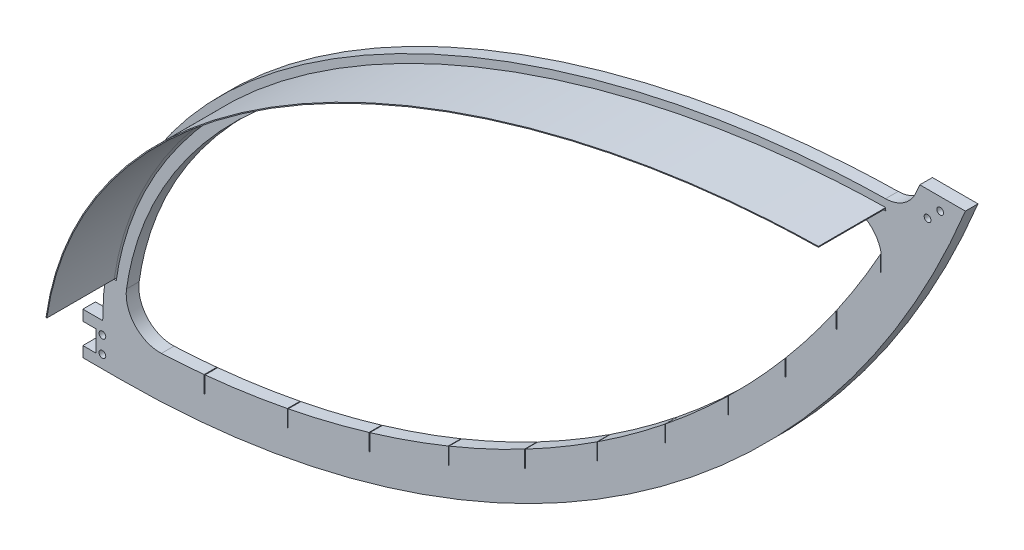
ISO-10303-21;
HEADER;
FILE_DESCRIPTION(('STEP AP214'),'2;1');
FILE_NAME('part.step','',(''),(''),'','','');
FILE_SCHEMA(('AUTOMOTIVE_DESIGN { 1 0 10303 214 1 1 1 1 }'));
ENDSEC;
DATA;
#1=APPLICATION_CONTEXT('core data for automotive mechanical design processes');
#2=APPLICATION_PROTOCOL_DEFINITION('international standard','automotive_design',2000,#1);
#3=PRODUCT_CONTEXT('',#1,'mechanical');
#4=PRODUCT('Part','Part','',(#3));
#5=PRODUCT_RELATED_PRODUCT_CATEGORY('part','',(#4));
#6=PRODUCT_DEFINITION_FORMATION('','',#4);
#7=PRODUCT_DEFINITION_CONTEXT('part definition',#1,'design');
#8=PRODUCT_DEFINITION('design','',#6,#7);
#9=PRODUCT_DEFINITION_SHAPE('','',#8);
#10=(LENGTH_UNIT() NAMED_UNIT(*) SI_UNIT(.MILLI.,.METRE.));
#11=(NAMED_UNIT(*) PLANE_ANGLE_UNIT() SI_UNIT($,.RADIAN.));
#12=(NAMED_UNIT(*) SI_UNIT($,.STERADIAN.) SOLID_ANGLE_UNIT());
#13=UNCERTAINTY_MEASURE_WITH_UNIT(LENGTH_MEASURE(1.E-05),#10,'distance_accuracy_value','');
#14=(GEOMETRIC_REPRESENTATION_CONTEXT(3) GLOBAL_UNCERTAINTY_ASSIGNED_CONTEXT((#13)) GLOBAL_UNIT_ASSIGNED_CONTEXT((#10,
#11,#12)) REPRESENTATION_CONTEXT('',''));
#15=CARTESIAN_POINT('',(0.,0.,0.));
#16=DIRECTION('',(0.,0.,1.));
#17=DIRECTION('',(1.,0.,0.));
#18=AXIS2_PLACEMENT_3D('',#15,#16,#17);
#19=CARTESIAN_POINT('',(12.3376916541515,-115.228608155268,17.5));
#20=CARTESIAN_POINT('',(12.8847329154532,-111.442909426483,17.5));
#21=CARTESIAN_POINT('',(13.7396908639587,-107.721970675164,17.5));
#22=CARTESIAN_POINT('',(16.0285565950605,-100.415641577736,17.5));
#23=CARTESIAN_POINT('',(17.4624533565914,-96.8330286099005,17.5));
#24=CARTESIAN_POINT('',(22.5778437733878,-86.3116391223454,17.5));
#25=CARTESIAN_POINT('',(27.0740926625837,-79.5955071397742,17.5));
#26=CARTESIAN_POINT('',(37.9375153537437,-66.8689150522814,17.5));
#27=CARTESIAN_POINT('',(44.3035608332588,-60.8591739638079,17.5));
#28=CARTESIAN_POINT('',(58.587183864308,-49.6606034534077,17.5));
#29=CARTESIAN_POINT('',(66.5037955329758,-44.4716891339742,17.5));
#30=CARTESIAN_POINT('',(92.0853507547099,-30.3029979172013,17.5));
#31=CARTESIAN_POINT('',(111.583403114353,-22.7215740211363,17.5));
#32=CARTESIAN_POINT('',(142.499420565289,-14.7678379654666,17.5));
#33=CARTESIAN_POINT('',(153.083223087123,-12.6858243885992,17.5));
#34=CARTESIAN_POINT('',(169.133835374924,-10.4913011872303,17.5));
#35=CARTESIAN_POINT('',(174.512488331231,-9.91454517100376,17.5));
#36=CARTESIAN_POINT('',(185.274132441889,-9.08294593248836,17.5));
#37=CARTESIAN_POINT('',(190.658553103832,-8.82807692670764,17.5));
#38=CARTESIAN_POINT('',(196.049379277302,-8.73981873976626,17.5));
#39=B_SPLINE_CURVE_WITH_KNOTS('',3,(#19,#20,#21,#22,#23,#24,#25,#26,#27,#28,#29,#30,#31,#32,#33,
#34,#35,#36,#37,#38),.UNSPECIFIED.,.F.,.F.,(4,2,2,2,2,2,2,2,2,4),(0.,0.0624999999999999,0.125,
0.25,0.375,0.5,0.75,0.875,0.9375,1.),.UNSPECIFIED.);
#40=DIRECTION('',(0.,0.,-1.));
#41=VECTOR('',#40,1.);
#42=SURFACE_OF_LINEAR_EXTRUSION('',#39,#41);
#43=CARTESIAN_POINT('',(12.3376916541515,-115.228608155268,1.5));
#44=CARTESIAN_POINT('',(12.8847329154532,-111.442909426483,1.5));
#45=CARTESIAN_POINT('',(13.7396908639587,-107.721970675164,1.5));
#46=CARTESIAN_POINT('',(16.0285565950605,-100.415641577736,1.5));
#47=CARTESIAN_POINT('',(17.4624533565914,-96.8330286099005,1.5));
#48=CARTESIAN_POINT('',(22.5778437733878,-86.3116391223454,1.5));
#49=CARTESIAN_POINT('',(27.0740926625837,-79.5955071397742,1.5));
#50=CARTESIAN_POINT('',(37.9375153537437,-66.8689150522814,1.5));
#51=CARTESIAN_POINT('',(44.3035608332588,-60.8591739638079,1.5));
#52=CARTESIAN_POINT('',(58.587183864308,-49.6606034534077,1.5));
#53=CARTESIAN_POINT('',(66.5037955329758,-44.4716891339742,1.5));
#54=CARTESIAN_POINT('',(92.0853507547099,-30.3029979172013,1.5));
#55=CARTESIAN_POINT('',(111.583403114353,-22.7215740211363,1.5));
#56=CARTESIAN_POINT('',(142.499420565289,-14.7678379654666,1.5));
#57=CARTESIAN_POINT('',(153.083223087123,-12.6858243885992,1.5));
#58=CARTESIAN_POINT('',(169.133835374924,-10.4913011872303,1.5));
#59=CARTESIAN_POINT('',(174.512488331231,-9.91454517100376,1.5));
#60=CARTESIAN_POINT('',(185.274132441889,-9.08294593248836,1.5));
#61=CARTESIAN_POINT('',(190.658553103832,-8.82807692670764,1.5));
#62=CARTESIAN_POINT('',(196.049379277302,-8.73981873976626,1.5));
#63=B_SPLINE_CURVE_WITH_KNOTS('',3,(#43,#44,#45,#46,#47,#48,#49,#50,#51,#52,#53,#54,#55,#56,#57,
#58,#59,#60,#61,#62),.UNSPECIFIED.,.F.,.F.,(4,2,2,2,2,2,2,2,2,4),(0.,0.0624999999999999,0.125,
0.25,0.375,0.5,0.75,0.875,0.9375,1.),.UNSPECIFIED.);
#64=CARTESIAN_POINT('',(12.3376916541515,-115.228608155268,1.5));
#65=VERTEX_POINT('',#64);
#66=CARTESIAN_POINT('',(196.049379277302,-8.73981873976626,1.5));
#67=VERTEX_POINT('',#66);
#68=EDGE_CURVE('E134',#65,#67,#63,.T.);
#69=ORIENTED_EDGE('',*,*,#68,.F.);
#70=DIRECTION('',(0.,0.,-1.));
#71=VECTOR('',#70,1.);
#72=CARTESIAN_POINT('',(12.3376916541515,-115.228608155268,17.5));
#73=LINE('',#72,#71);
#74=CARTESIAN_POINT('',(12.3376916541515,-115.228608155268,17.5));
#75=VERTEX_POINT('',#74);
#76=EDGE_CURVE('E135',#75,#65,#73,.T.);
#77=ORIENTED_EDGE('',*,*,#76,.F.);
#78=CARTESIAN_POINT('',(196.049379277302,-8.73981873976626,17.5));
#79=VERTEX_POINT('',#78);
#80=EDGE_CURVE('E107',#75,#79,#39,.T.);
#81=ORIENTED_EDGE('',*,*,#80,.T.);
#82=DIRECTION('',(0.,0.,-1.));
#83=VECTOR('',#82,1.);
#84=CARTESIAN_POINT('',(196.049379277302,-8.73981873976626,17.5));
#85=LINE('',#84,#83);
#86=EDGE_CURVE('E12',#79,#67,#85,.T.);
#87=ORIENTED_EDGE('',*,*,#86,.T.);
#88=EDGE_LOOP('',(#69,#77,#81,#87));
#89=FACE_BOUND('',#88,.T.);
#90=ADVANCED_FACE('F49',(#89),#42,.T.);
#91=CARTESIAN_POINT('',(196.052653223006,-8.93979194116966,17.5));
#92=DIRECTION('',(0.999866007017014,0.0163697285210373,0.));
#93=DIRECTION('',(-0.0163697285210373,0.999866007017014,0.));
#94=AXIS2_PLACEMENT_3D('',#91,#92,#93);
#95=PLANE('',#94);
#96=DIRECTION('',(-0.0163697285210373,0.999866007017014,0.));
#97=VECTOR('',#96,1.);
#98=CARTESIAN_POINT('',(196.052653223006,-8.93979194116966,1.5));
#99=LINE('',#98,#97);
#100=CARTESIAN_POINT('',(196.052653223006,-8.93979194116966,1.5));
#101=VERTEX_POINT('',#100);
#102=EDGE_CURVE('E136',#101,#67,#99,.T.);
#103=ORIENTED_EDGE('',*,*,#102,.T.);
#104=ORIENTED_EDGE('',*,*,#86,.F.);
#105=DIRECTION('',(-0.0163697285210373,0.999866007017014,0.));
#106=VECTOR('',#105,1.);
#107=CARTESIAN_POINT('',(196.052653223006,-8.93979194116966,17.5));
#108=LINE('',#107,#106);
#109=CARTESIAN_POINT('',(196.052653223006,-8.93979194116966,17.5));
#110=VERTEX_POINT('',#109);
#111=EDGE_CURVE('E91',#110,#79,#108,.T.);
#112=ORIENTED_EDGE('',*,*,#111,.F.);
#113=DIRECTION('',(0.,0.,-1.));
#114=VECTOR('',#113,1.);
#115=CARTESIAN_POINT('',(196.052653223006,-8.93979194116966,17.5));
#116=LINE('',#115,#114);
#117=EDGE_CURVE('E58',#110,#101,#116,.T.);
#118=ORIENTED_EDGE('',*,*,#117,.T.);
#119=EDGE_LOOP('',(#103,#104,#112,#118));
#120=FACE_BOUND('',#119,.T.);
#121=ADVANCED_FACE('F105',(#120),#95,.T.);
#122=CARTESIAN_POINT('',(12.5356357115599,-115.257211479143,17.5));
#123=CARTESIAN_POINT('',(12.6416620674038,-114.523475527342,17.5));
#124=CARTESIAN_POINT('',(13.3969785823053,-109.829772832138,17.5));
#125=CARTESIAN_POINT('',(15.6617821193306,-101.350586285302,17.5));
#126=CARTESIAN_POINT('',(20.6662774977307,-90.1822231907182,17.5));
#127=CARTESIAN_POINT('',(29.6967911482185,-75.9631477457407,17.5));
#128=CARTESIAN_POINT('',(45.0838838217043,-59.572850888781,17.5));
#129=CARTESIAN_POINT('',(69.0061171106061,-42.5253307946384,17.5));
#130=CARTESIAN_POINT('',(97.23418412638,-28.4965015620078,17.5));
#131=CARTESIAN_POINT('',(128.606967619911,-17.8605763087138,17.5));
#132=CARTESIAN_POINT('',(156.392539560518,-12.12512414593,17.5));
#133=CARTESIAN_POINT('',(179.038682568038,-9.58826858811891,17.5));
#134=CARTESIAN_POINT('',(190.376638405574,-9.03271921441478,17.5));
#135=CARTESIAN_POINT('',(196.052653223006,-8.93979194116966,17.5));
#136=B_SPLINE_CURVE_WITH_KNOTS('',3,(#122,#123,#124,#125,#126,#127,#128,#129,#130,#131,#132,
#133,#134,#135),.UNSPECIFIED.,.F.,.F.,(4,1,1,1,1,1,1,1,1,1,1,4),(0.0431926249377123,
0.0529625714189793,0.105925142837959,0.158887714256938,0.211850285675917,0.317775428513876,
0.423700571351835,0.529625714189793,0.635550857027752,0.741475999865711,0.79443857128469,
0.84740114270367),.UNSPECIFIED.);
#137=DIRECTION('',(0.,0.,-1.));
#138=VECTOR('',#137,1.);
#139=SURFACE_OF_LINEAR_EXTRUSION('',#136,#138);
#140=CARTESIAN_POINT('',(12.5356357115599,-115.257211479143,1.5));
#141=CARTESIAN_POINT('',(12.6416620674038,-114.523475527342,1.5));
#142=CARTESIAN_POINT('',(13.3969785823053,-109.829772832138,1.5));
#143=CARTESIAN_POINT('',(15.6617821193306,-101.350586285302,1.5));
#144=CARTESIAN_POINT('',(20.6662774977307,-90.1822231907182,1.5));
#145=CARTESIAN_POINT('',(29.6967911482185,-75.9631477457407,1.5));
#146=CARTESIAN_POINT('',(45.0838838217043,-59.572850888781,1.5));
#147=CARTESIAN_POINT('',(69.0061171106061,-42.5253307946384,1.5));
#148=CARTESIAN_POINT('',(97.23418412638,-28.4965015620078,1.5));
#149=CARTESIAN_POINT('',(128.606967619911,-17.8605763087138,1.5));
#150=CARTESIAN_POINT('',(156.392539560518,-12.12512414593,1.5));
#151=CARTESIAN_POINT('',(179.038682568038,-9.58826858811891,1.5));
#152=CARTESIAN_POINT('',(190.376638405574,-9.03271921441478,1.5));
#153=CARTESIAN_POINT('',(196.052653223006,-8.93979194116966,1.5));
#154=B_SPLINE_CURVE_WITH_KNOTS('',3,(#140,#141,#142,#143,#144,#145,#146,#147,#148,#149,#150,
#151,#152,#153),.UNSPECIFIED.,.F.,.F.,(4,1,1,1,1,1,1,1,1,1,1,4),(0.0431926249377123,
0.0529625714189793,0.105925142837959,0.158887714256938,0.211850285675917,0.317775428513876,
0.423700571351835,0.529625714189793,0.635550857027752,0.741475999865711,0.79443857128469,
0.84740114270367),.UNSPECIFIED.);
#155=CARTESIAN_POINT('',(12.5356357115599,-115.257211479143,1.5));
#156=VERTEX_POINT('',#155);
#157=EDGE_CURVE('E101',#156,#101,#154,.T.);
#158=ORIENTED_EDGE('',*,*,#157,.T.);
#159=ORIENTED_EDGE('',*,*,#117,.F.);
#160=CARTESIAN_POINT('',(12.5356357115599,-115.257211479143,17.5));
#161=VERTEX_POINT('',#160);
#162=EDGE_CURVE('E94',#161,#110,#136,.T.);
#163=ORIENTED_EDGE('',*,*,#162,.F.);
#164=DIRECTION('',(0.,0.,-1.));
#165=VECTOR('',#164,1.);
#166=CARTESIAN_POINT('',(12.5356357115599,-115.257211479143,17.5));
#167=LINE('',#166,#165);
#168=EDGE_CURVE('E104',#161,#156,#167,.T.);
#169=ORIENTED_EDGE('',*,*,#168,.T.);
#170=EDGE_LOOP('',(#158,#159,#163,#169));
#171=FACE_BOUND('',#170,.T.);
#172=ADVANCED_FACE('F100',(#171),#139,.F.);
#173=CARTESIAN_POINT('',(12.3376916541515,-115.228608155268,17.5));
#174=DIRECTION('',(-0.143016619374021,-0.989720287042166,0.));
#175=DIRECTION('',(0.989720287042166,-0.143016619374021,0.));
#176=AXIS2_PLACEMENT_3D('',#173,#174,#175);
#177=PLANE('',#176);
#178=DIRECTION('',(0.989720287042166,-0.143016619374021,0.));
#179=VECTOR('',#178,1.);
#180=CARTESIAN_POINT('',(12.3376916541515,-115.228608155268,1.5));
#181=LINE('',#180,#179);
#182=EDGE_CURVE('E80',#65,#156,#181,.T.);
#183=ORIENTED_EDGE('',*,*,#182,.T.);
#184=ORIENTED_EDGE('',*,*,#168,.F.);
#185=DIRECTION('',(0.989720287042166,-0.143016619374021,0.));
#186=VECTOR('',#185,1.);
#187=CARTESIAN_POINT('',(12.3376916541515,-115.228608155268,17.5));
#188=LINE('',#187,#186);
#189=EDGE_CURVE('E66',#75,#161,#188,.T.);
#190=ORIENTED_EDGE('',*,*,#189,.F.);
#191=ORIENTED_EDGE('',*,*,#76,.T.);
#192=EDGE_LOOP('',(#183,#184,#190,#191));
#193=FACE_BOUND('',#192,.T.);
#194=ADVANCED_FACE('F123',(#193),#177,.T.);
#195=CARTESIAN_POINT('',(75.0309806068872,-39.7487920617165,17.5));
#196=DIRECTION('',(0.,0.,-1.));
#197=DIRECTION('',(1.,0.,0.));
#198=AXIS2_PLACEMENT_3D('',#195,#196,#197);
#199=PLANE('',#198);
#200=ORIENTED_EDGE('',*,*,#80,.F.);
#201=ORIENTED_EDGE('',*,*,#189,.T.);
#202=ORIENTED_EDGE('',*,*,#162,.T.);
#203=ORIENTED_EDGE('',*,*,#111,.T.);
#204=EDGE_LOOP('',(#200,#201,#202,#203));
#205=FACE_BOUND('',#204,.T.);
#206=ADVANCED_FACE('F96',(#205),#199,.F.);
#207=CARTESIAN_POINT('',(75.0309806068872,-39.7487920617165,1.5));
#208=DIRECTION('',(0.,0.,-1.));
#209=DIRECTION('',(1.,0.,0.));
#210=AXIS2_PLACEMENT_3D('',#207,#208,#209);
#211=PLANE('',#210);
#212=ORIENTED_EDGE('',*,*,#68,.T.);
#213=ORIENTED_EDGE('',*,*,#102,.F.);
#214=ORIENTED_EDGE('',*,*,#157,.F.);
#215=ORIENTED_EDGE('',*,*,#182,.F.);
#216=EDGE_LOOP('',(#212,#213,#214,#215));
#217=FACE_BOUND('',#216,.T.);
#218=ADVANCED_FACE('F152',(#217),#211,.T.);
#219=CLOSED_SHELL('',(#90,#121,#172,#194,#206,#218));
#220=MANIFOLD_SOLID_BREP('B2_NOT_SHOWN',#219);
#221=CARTESIAN_POINT('',(14.,81.9083187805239,-1.5));
#222=DIRECTION('',(0.,0.,1.));
#223=DIRECTION('',(-1.,0.,0.));
#224=AXIS2_PLACEMENT_3D('',#221,#222,#223);
#225=CYLINDRICAL_SURFACE('',#224,207.048318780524);
#226=CARTESIAN_POINT('',(14.,81.9083187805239,1.5));
#227=DIRECTION('',(0.,0.,-1.));
#228=DIRECTION('',(1.,0.,0.));
#229=AXIS2_PLACEMENT_3D('',#226,#227,#228);
#230=CIRCLE('',#229,207.048318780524);
#231=CARTESIAN_POINT('',(204.157917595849,0.,1.5));
#232=VERTEX_POINT('',#231);
#233=CARTESIAN_POINT('',(203.199320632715,-2.1905717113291,1.5));
#234=VERTEX_POINT('',#233);
#235=EDGE_CURVE('E927',#232,#234,#230,.T.);
#236=ORIENTED_EDGE('',*,*,#235,.F.);
#237=DIRECTION('',(0.,0.,1.));
#238=VECTOR('',#237,1.);
#239=CARTESIAN_POINT('',(204.157917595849,0.,-1.5));
#240=LINE('',#239,#238);
#241=CARTESIAN_POINT('',(204.157917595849,0.,-1.5));
#242=VERTEX_POINT('',#241);
#243=EDGE_CURVE('E936',#242,#232,#240,.T.);
#244=ORIENTED_EDGE('',*,*,#243,.F.);
#245=CARTESIAN_POINT('',(14.,81.9083187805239,-1.5));
#246=DIRECTION('',(0.,0.,-1.));
#247=DIRECTION('',(1.,0.,0.));
#248=AXIS2_PLACEMENT_3D('',#245,#246,#247);
#249=CIRCLE('',#248,207.048318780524);
#250=CARTESIAN_POINT('',(203.199320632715,-2.1905717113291,-1.5));
#251=VERTEX_POINT('',#250);
#252=EDGE_CURVE('E910',#242,#251,#249,.T.);
#253=ORIENTED_EDGE('',*,*,#252,.T.);
#254=DIRECTION('',(0.,0.,1.));
#255=VECTOR('',#254,1.);
#256=CARTESIAN_POINT('',(203.199320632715,-2.19057171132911,-1.5));
#257=LINE('',#256,#255);
#258=EDGE_CURVE('E1010',#234,#251,#257,.F.);
#259=ORIENTED_EDGE('',*,*,#258,.F.);
#260=EDGE_LOOP('',(#236,#244,#253,#259));
#261=FACE_BOUND('',#260,.T.);
#262=ADVANCED_FACE('F195',(#261),#225,.F.);
#263=CARTESIAN_POINT('',(5.10000000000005,-125.14,-1.5));
#264=DIRECTION('',(1.,0.,0.));
#265=DIRECTION('',(0.,0.,1.));
#266=AXIS2_PLACEMENT_3D('',#263,#264,#265);
#267=PLANE('',#266);
#268=DIRECTION('',(0.,-1.,0.));
#269=VECTOR('',#268,1.);
#270=CARTESIAN_POINT('',(5.10000000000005,-125.14,1.5));
#271=LINE('',#270,#269);
#272=CARTESIAN_POINT('',(5.10000000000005,-125.14,1.5));
#273=VERTEX_POINT('',#272);
#274=CARTESIAN_POINT('',(5.10000000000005,-127.64,1.5));
#275=VERTEX_POINT('',#274);
#276=EDGE_CURVE('E1043',#273,#275,#271,.T.);
#277=ORIENTED_EDGE('',*,*,#276,.F.);
#278=DIRECTION('',(0.,0.,1.));
#279=VECTOR('',#278,1.);
#280=CARTESIAN_POINT('',(5.10000000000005,-125.14,-1.5));
#281=LINE('',#280,#279);
#282=CARTESIAN_POINT('',(5.10000000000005,-125.14,-1.5));
#283=VERTEX_POINT('',#282);
#284=EDGE_CURVE('E1045',#283,#273,#281,.T.);
#285=ORIENTED_EDGE('',*,*,#284,.F.);
#286=DIRECTION('',(0.,-1.,0.));
#287=VECTOR('',#286,1.);
#288=CARTESIAN_POINT('',(5.10000000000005,-125.14,-1.5));
#289=LINE('',#288,#287);
#290=CARTESIAN_POINT('',(5.10000000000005,-127.64,-1.5));
#291=VERTEX_POINT('',#290);
#292=EDGE_CURVE('E1057',#283,#291,#289,.T.);
#293=ORIENTED_EDGE('',*,*,#292,.T.);
#294=DIRECTION('',(0.,0.,1.));
#295=VECTOR('',#294,1.);
#296=CARTESIAN_POINT('',(5.10000000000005,-127.64,-1.501));
#297=LINE('',#296,#295);
#298=EDGE_CURVE('E1052',#291,#275,#297,.T.);
#299=ORIENTED_EDGE('',*,*,#298,.T.);
#300=EDGE_LOOP('',(#277,#285,#293,#299));
#301=FACE_BOUND('',#300,.T.);
#302=ADVANCED_FACE('F683',(#301),#267,.F.);
#303=CARTESIAN_POINT('',(33.9679703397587,-124.174884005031,1.5));
#304=VERTEX_POINT('',#303);
#305=CARTESIAN_POINT('',(23.7875037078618,-124.908535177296,1.5));
#306=VERTEX_POINT('',#305);
#307=EDGE_CURVE('E926',#304,#306,#230,.T.);
#308=ORIENTED_EDGE('',*,*,#307,.F.);
#309=DIRECTION('',(0.,0.,1.));
#310=VECTOR('',#309,1.);
#311=CARTESIAN_POINT('',(33.9679703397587,-124.174884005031,-1.5));
#312=LINE('',#311,#310);
#313=CARTESIAN_POINT('',(33.9679703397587,-124.174884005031,-1.5));
#314=VERTEX_POINT('',#313);
#315=EDGE_CURVE('E887',#304,#314,#312,.F.);
#316=ORIENTED_EDGE('',*,*,#315,.T.);
#317=CARTESIAN_POINT('',(23.7875037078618,-124.908535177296,-1.5));
#318=VERTEX_POINT('',#317);
#319=EDGE_CURVE('E909',#314,#318,#249,.T.);
#320=ORIENTED_EDGE('',*,*,#319,.T.);
#321=DIRECTION('',(0.,0.,1.));
#322=VECTOR('',#321,1.);
#323=CARTESIAN_POINT('',(23.7875037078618,-124.908535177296,-1.5));
#324=LINE('',#323,#322);
#325=EDGE_CURVE('E1001',#306,#318,#324,.F.);
#326=ORIENTED_EDGE('',*,*,#325,.F.);
#327=EDGE_LOOP('',(#308,#316,#320,#326));
#328=FACE_BOUND('',#327,.T.);
#329=ADVANCED_FACE('F840',(#328),#225,.F.);
#330=DIRECTION('',(0.,0.,1.));
#331=VECTOR('',#330,1.);
#332=CARTESIAN_POINT('',(34.1679703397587,-124.155407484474,-1.5));
#333=LINE('',#332,#331);
#334=CARTESIAN_POINT('',(34.1679703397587,-124.155407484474,-1.5));
#335=VERTEX_POINT('',#334);
#336=CARTESIAN_POINT('',(34.1679703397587,-124.155407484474,1.5));
#337=VERTEX_POINT('',#336);
#338=EDGE_CURVE('E880',#335,#337,#333,.T.);
#339=ORIENTED_EDGE('',*,*,#338,.T.);
#340=CARTESIAN_POINT('',(53.7479046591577,-121.288901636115,1.5));
#341=VERTEX_POINT('',#340);
#342=EDGE_CURVE('E883',#341,#337,#230,.T.);
#343=ORIENTED_EDGE('',*,*,#342,.F.);
#344=DIRECTION('',(0.,0.,1.));
#345=VECTOR('',#344,1.);
#346=CARTESIAN_POINT('',(53.7479046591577,-121.288901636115,-1.5));
#347=LINE('',#346,#345);
#348=CARTESIAN_POINT('',(53.7479046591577,-121.288901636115,-1.5));
#349=VERTEX_POINT('',#348);
#350=EDGE_CURVE('E888',#341,#349,#347,.F.);
#351=ORIENTED_EDGE('',*,*,#350,.T.);
#352=EDGE_CURVE('E885',#349,#335,#249,.T.);
#353=ORIENTED_EDGE('',*,*,#352,.T.);
#354=EDGE_LOOP('',(#339,#343,#351,#353));
#355=FACE_BOUND('',#354,.T.);
#356=ADVANCED_FACE('F843',(#355),#225,.F.);
#357=DIRECTION('',(0.,0.,1.));
#358=VECTOR('',#357,1.);
#359=CARTESIAN_POINT('',(53.9479046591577,-121.249676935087,-1.5));
#360=LINE('',#359,#358);
#361=CARTESIAN_POINT('',(53.9479046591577,-121.249676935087,-1.5));
#362=VERTEX_POINT('',#361);
#363=CARTESIAN_POINT('',(53.9479046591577,-121.249676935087,1.5));
#364=VERTEX_POINT('',#363);
#365=EDGE_CURVE('E893',#362,#364,#360,.T.);
#366=ORIENTED_EDGE('',*,*,#365,.T.);
#367=CARTESIAN_POINT('',(73.1553847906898,-116.509540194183,1.5));
#368=VERTEX_POINT('',#367);
#369=EDGE_CURVE('E1295',#368,#364,#230,.T.);
#370=ORIENTED_EDGE('',*,*,#369,.F.);
#371=DIRECTION('',(0.,0.,1.));
#372=VECTOR('',#371,1.);
#373=CARTESIAN_POINT('',(73.1553847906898,-116.509540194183,-1.5));
#374=LINE('',#373,#372);
#375=CARTESIAN_POINT('',(73.1553847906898,-116.509540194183,-1.5));
#376=VERTEX_POINT('',#375);
#377=EDGE_CURVE('E1288',#368,#376,#374,.F.);
#378=ORIENTED_EDGE('',*,*,#377,.T.);
#379=EDGE_CURVE('E1297',#376,#362,#249,.T.);
#380=ORIENTED_EDGE('',*,*,#379,.T.);
#381=EDGE_LOOP('',(#366,#370,#378,#380));
#382=FACE_BOUND('',#381,.T.);
#383=ADVANCED_FACE('F869',(#382),#225,.F.);
#384=DIRECTION('',(0.,0.,1.));
#385=VECTOR('',#384,1.);
#386=CARTESIAN_POINT('',(73.3553847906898,-116.449803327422,-1.5));
#387=LINE('',#386,#385);
#388=CARTESIAN_POINT('',(73.3553847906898,-116.449803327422,-1.5));
#389=VERTEX_POINT('',#388);
#390=CARTESIAN_POINT('',(73.3553847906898,-116.449803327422,1.5));
#391=VERTEX_POINT('',#390);
#392=EDGE_CURVE('E1285',#389,#391,#387,.T.);
#393=ORIENTED_EDGE('',*,*,#392,.T.);
#394=CARTESIAN_POINT('',(92.0094651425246,-109.882008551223,1.5));
#395=VERTEX_POINT('',#394);
#396=EDGE_CURVE('E1303',#395,#391,#230,.T.);
#397=ORIENTED_EDGE('',*,*,#396,.F.);
#398=DIRECTION('',(0.,0.,1.));
#399=VECTOR('',#398,1.);
#400=CARTESIAN_POINT('',(92.0094651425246,-109.882008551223,-1.5));
#401=LINE('',#400,#399);
#402=CARTESIAN_POINT('',(92.0094651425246,-109.882008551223,-1.5));
#403=VERTEX_POINT('',#402);
#404=EDGE_CURVE('E1282',#395,#403,#401,.F.);
#405=ORIENTED_EDGE('',*,*,#404,.T.);
#406=EDGE_CURVE('E1440',#403,#389,#249,.T.);
#407=ORIENTED_EDGE('',*,*,#406,.T.);
#408=EDGE_LOOP('',(#393,#397,#405,#407));
#409=FACE_BOUND('',#408,.T.);
#410=ADVANCED_FACE('F874',(#409),#225,.F.);
#411=DIRECTION('',(0.,0.,1.));
#412=VECTOR('',#411,1.);
#413=CARTESIAN_POINT('',(92.2094651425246,-109.800538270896,-1.5));
#414=LINE('',#413,#412);
#415=CARTESIAN_POINT('',(92.2094651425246,-109.800538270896,-1.5));
#416=VERTEX_POINT('',#415);
#417=CARTESIAN_POINT('',(92.2094651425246,-109.800538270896,1.5));
#418=VERTEX_POINT('',#417);
#419=EDGE_CURVE('E1279',#416,#418,#414,.T.);
#420=ORIENTED_EDGE('',*,*,#419,.T.);
#421=CARTESIAN_POINT('',(110.134359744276,-101.468864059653,1.5));
#422=VERTEX_POINT('',#421);
#423=EDGE_CURVE('E1305',#422,#418,#230,.T.);
#424=ORIENTED_EDGE('',*,*,#423,.F.);
#425=DIRECTION('',(0.,0.,1.));
#426=VECTOR('',#425,1.);
#427=CARTESIAN_POINT('',(110.134359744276,-101.468864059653,-1.5));
#428=LINE('',#427,#426);
#429=CARTESIAN_POINT('',(110.134359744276,-101.468864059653,-1.5));
#430=VERTEX_POINT('',#429);
#431=EDGE_CURVE('E1276',#422,#430,#428,.F.);
#432=ORIENTED_EDGE('',*,*,#431,.T.);
#433=EDGE_CURVE('E1430',#430,#416,#249,.T.);
#434=ORIENTED_EDGE('',*,*,#433,.T.);
#435=EDGE_LOOP('',(#420,#424,#432,#434));
#436=FACE_BOUND('',#435,.T.);
#437=ADVANCED_FACE('F1428',(#436),#225,.F.);
#438=DIRECTION('',(0.,0.,1.));
#439=VECTOR('',#438,1.);
#440=CARTESIAN_POINT('',(110.334359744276,-101.363876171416,-1.5));
#441=LINE('',#440,#439);
#442=CARTESIAN_POINT('',(110.334359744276,-101.363876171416,-1.5));
#443=VERTEX_POINT('',#442);
#444=CARTESIAN_POINT('',(110.334359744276,-101.363876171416,1.5));
#445=VERTEX_POINT('',#444);
#446=EDGE_CURVE('E1273',#443,#445,#441,.T.);
#447=ORIENTED_EDGE('',*,*,#446,.T.);
#448=CARTESIAN_POINT('',(127.361081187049,-91.34949946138,1.5));
#449=VERTEX_POINT('',#448);
#450=EDGE_CURVE('E1415',#449,#445,#230,.T.);
#451=ORIENTED_EDGE('',*,*,#450,.F.);
#452=DIRECTION('',(0.,0.,1.));
#453=VECTOR('',#452,1.);
#454=CARTESIAN_POINT('',(127.361081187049,-91.34949946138,-1.5));
#455=LINE('',#454,#453);
#456=CARTESIAN_POINT('',(127.361081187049,-91.34949946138,-1.5));
#457=VERTEX_POINT('',#456);
#458=EDGE_CURVE('E1270',#449,#457,#455,.F.);
#459=ORIENTED_EDGE('',*,*,#458,.T.);
#460=EDGE_CURVE('E1443',#457,#443,#249,.T.);
#461=ORIENTED_EDGE('',*,*,#460,.T.);
#462=EDGE_LOOP('',(#447,#451,#459,#461));
#463=FACE_BOUND('',#462,.T.);
#464=ADVANCED_FACE('F1487',(#463),#225,.F.);
#465=DIRECTION('',(0.,0.,1.));
#466=VECTOR('',#465,1.);
#467=CARTESIAN_POINT('',(127.561081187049,-91.2184762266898,-1.5));
#468=LINE('',#467,#466);
#469=CARTESIAN_POINT('',(127.561081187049,-91.2184762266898,-1.5));
#470=VERTEX_POINT('',#469);
#471=CARTESIAN_POINT('',(127.561081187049,-91.2184762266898,1.5));
#472=VERTEX_POINT('',#471);
#473=EDGE_CURVE('E1267',#470,#472,#468,.T.);
#474=ORIENTED_EDGE('',*,*,#473,.T.);
#475=CARTESIAN_POINT('',(143.529016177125,-79.6195124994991,1.5));
#476=VERTEX_POINT('',#475);
#477=EDGE_CURVE('E1411',#476,#472,#230,.T.);
#478=ORIENTED_EDGE('',*,*,#477,.F.);
#479=DIRECTION('',(0.,0.,1.));
#480=VECTOR('',#479,1.);
#481=CARTESIAN_POINT('',(143.529016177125,-79.6195124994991,-1.5));
#482=LINE('',#481,#480);
#483=CARTESIAN_POINT('',(143.529016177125,-79.6195124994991,-1.5));
#484=VERTEX_POINT('',#483);
#485=EDGE_CURVE('E1264',#476,#484,#482,.F.);
#486=ORIENTED_EDGE('',*,*,#485,.T.);
#487=EDGE_CURVE('E1445',#484,#470,#249,.T.);
#488=ORIENTED_EDGE('',*,*,#487,.T.);
#489=EDGE_LOOP('',(#474,#478,#486,#488));
#490=FACE_BOUND('',#489,.T.);
#491=ADVANCED_FACE('F1483',(#490),#225,.F.);
#492=DIRECTION('',(0.,0.,1.));
#493=VECTOR('',#492,1.);
#494=CARTESIAN_POINT('',(143.729016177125,-79.4589290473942,-1.5));
#495=LINE('',#494,#493);
#496=CARTESIAN_POINT('',(143.729016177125,-79.4589290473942,-1.5));
#497=VERTEX_POINT('',#496);
#498=CARTESIAN_POINT('',(143.729016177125,-79.4589290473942,1.5));
#499=VERTEX_POINT('',#498);
#500=EDGE_CURVE('E1261',#497,#499,#495,.T.);
#501=ORIENTED_EDGE('',*,*,#500,.T.);
#502=CARTESIAN_POINT('',(158.487423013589,-66.3899984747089,1.5));
#503=VERTEX_POINT('',#502);
#504=EDGE_CURVE('E1407',#503,#499,#230,.T.);
#505=ORIENTED_EDGE('',*,*,#504,.F.);
#506=DIRECTION('',(0.,0.,1.));
#507=VECTOR('',#506,1.);
#508=CARTESIAN_POINT('',(158.487423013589,-66.3899984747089,-1.5));
#509=LINE('',#508,#507);
#510=CARTESIAN_POINT('',(158.487423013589,-66.3899984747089,-1.5));
#511=VERTEX_POINT('',#510);
#512=EDGE_CURVE('E1258',#503,#511,#509,.F.);
#513=ORIENTED_EDGE('',*,*,#512,.T.);
#514=EDGE_CURVE('E1450',#511,#497,#249,.T.);
#515=ORIENTED_EDGE('',*,*,#514,.T.);
#516=EDGE_LOOP('',(#501,#505,#513,#515));
#517=FACE_BOUND('',#516,.T.);
#518=ADVANCED_FACE('F1479',(#517),#225,.F.);
#519=DIRECTION('',(0.,0.,1.));
#520=VECTOR('',#519,1.);
#521=CARTESIAN_POINT('',(158.687423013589,-66.1948747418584,-1.5));
#522=LINE('',#521,#520);
#523=CARTESIAN_POINT('',(158.687423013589,-66.1948747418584,-1.5));
#524=VERTEX_POINT('',#523);
#525=CARTESIAN_POINT('',(158.687423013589,-66.1948747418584,1.5));
#526=VERTEX_POINT('',#525);
#527=EDGE_CURVE('E1255',#524,#526,#522,.T.);
#528=ORIENTED_EDGE('',*,*,#527,.T.);
#529=CARTESIAN_POINT('',(172.096837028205,-51.7868435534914,1.5));
#530=VERTEX_POINT('',#529);
#531=EDGE_CURVE('E1403',#530,#526,#230,.T.);
#532=ORIENTED_EDGE('',*,*,#531,.F.);
#533=DIRECTION('',(0.,0.,1.));
#534=VECTOR('',#533,1.);
#535=CARTESIAN_POINT('',(172.096837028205,-51.7868435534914,-1.5));
#536=LINE('',#535,#534);
#537=CARTESIAN_POINT('',(172.096837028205,-51.7868435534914,-1.5));
#538=VERTEX_POINT('',#537);
#539=EDGE_CURVE('E1252',#530,#538,#536,.F.);
#540=ORIENTED_EDGE('',*,*,#539,.T.);
#541=EDGE_CURVE('E1455',#538,#524,#249,.T.);
#542=ORIENTED_EDGE('',*,*,#541,.T.);
#543=EDGE_LOOP('',(#528,#532,#540,#542));
#544=FACE_BOUND('',#543,.T.);
#545=ADVANCED_FACE('F1475',(#544),#225,.F.);
#546=DIRECTION('',(0.,0.,1.));
#547=VECTOR('',#546,1.);
#548=CARTESIAN_POINT('',(172.296837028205,-51.5499806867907,-1.5));
#549=LINE('',#548,#547);
#550=CARTESIAN_POINT('',(172.296837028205,-51.5499806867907,-1.5));
#551=VERTEX_POINT('',#550);
#552=CARTESIAN_POINT('',(172.296837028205,-51.5499806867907,1.5));
#553=VERTEX_POINT('',#552);
#554=EDGE_CURVE('E1249',#551,#553,#549,.T.);
#555=ORIENTED_EDGE('',*,*,#554,.T.);
#556=CARTESIAN_POINT('',(184.230370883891,-35.9501859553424,1.5));
#557=VERTEX_POINT('',#556);
#558=EDGE_CURVE('E1401',#557,#553,#230,.T.);
#559=ORIENTED_EDGE('',*,*,#558,.F.);
#560=DIRECTION('',(0.,0.,1.));
#561=VECTOR('',#560,1.);
#562=CARTESIAN_POINT('',(184.230370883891,-35.9501859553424,-1.5));
#563=LINE('',#562,#561);
#564=CARTESIAN_POINT('',(184.230370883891,-35.9501859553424,-1.5));
#565=VERTEX_POINT('',#564);
#566=EDGE_CURVE('E1246',#557,#565,#563,.F.);
#567=ORIENTED_EDGE('',*,*,#566,.T.);
#568=EDGE_CURVE('E1460',#565,#551,#249,.T.);
#569=ORIENTED_EDGE('',*,*,#568,.T.);
#570=EDGE_LOOP('',(#555,#559,#567,#569));
#571=FACE_BOUND('',#570,.T.);
#572=ADVANCED_FACE('F1471',(#571),#225,.F.);
#573=DIRECTION('',(0.,0.,1.));
#574=VECTOR('',#573,1.);
#575=CARTESIAN_POINT('',(184.430370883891,-35.6607885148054,-1.5));
#576=LINE('',#575,#574);
#577=CARTESIAN_POINT('',(184.430370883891,-35.6607885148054,-1.5));
#578=VERTEX_POINT('',#577);
#579=CARTESIAN_POINT('',(184.430370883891,-35.6607885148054,1.5));
#580=VERTEX_POINT('',#579);
#581=EDGE_CURVE('E1243',#578,#580,#576,.T.);
#582=ORIENTED_EDGE('',*,*,#581,.T.);
#583=CARTESIAN_POINT('',(194.77489760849,-19.0344506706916,1.5));
#584=VERTEX_POINT('',#583);
#585=EDGE_CURVE('E931',#584,#580,#230,.T.);
#586=ORIENTED_EDGE('',*,*,#585,.F.);
#587=DIRECTION('',(0.,0.,1.));
#588=VECTOR('',#587,1.);
#589=CARTESIAN_POINT('',(194.77489760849,-19.0344506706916,-1.5));
#590=LINE('',#589,#588);
#591=CARTESIAN_POINT('',(194.77489760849,-19.0344506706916,-1.5));
#592=VERTEX_POINT('',#591);
#593=EDGE_CURVE('E1240',#584,#592,#590,.F.);
#594=ORIENTED_EDGE('',*,*,#593,.T.);
#595=EDGE_CURVE('E914',#592,#578,#249,.T.);
#596=ORIENTED_EDGE('',*,*,#595,.T.);
#597=EDGE_LOOP('',(#582,#586,#594,#596));
#598=FACE_BOUND('',#597,.T.);
#599=ADVANCED_FACE('F827',(#598),#225,.F.);
#600=CARTESIAN_POINT('',(14.,81.9083187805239,-1.5));
#601=DIRECTION('',(0.,0.,1.));
#602=DIRECTION('',(-1.,0.,0.));
#603=AXIS2_PLACEMENT_3D('',#600,#601,#602);
#604=PLANE('',#603);
#605=DIRECTION('',(0.989049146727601,-0.147586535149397,0.));
#606=VECTOR('',#605,1.);
#607=CARTESIAN_POINT('',(12.5356357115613,-115.257211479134,-1.5));
#608=LINE('',#607,#606);
#609=CARTESIAN_POINT('',(12.5356357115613,-115.257211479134,-1.5));
#610=VERTEX_POINT('',#609);
#611=CARTESIAN_POINT('',(13.0301663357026,-115.331005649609,-1.5));
#612=VERTEX_POINT('',#611);
#613=EDGE_CURVE('E607',#610,#612,#608,.T.);
#614=ORIENTED_EDGE('',*,*,#613,.T.);
#615=CARTESIAN_POINT('',(196.060837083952,-9.43972496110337,-1.5));
#616=CARTESIAN_POINT('',(190.395470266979,-9.53247792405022,-1.5));
#617=CARTESIAN_POINT('',(179.079077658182,-10.0869687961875,-1.5));
#618=CARTESIAN_POINT('',(156.473659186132,-12.6192240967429,-1.5));
#619=CARTESIAN_POINT('',(128.737501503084,-18.3445213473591,-1.5));
#620=CARTESIAN_POINT('',(97.4246514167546,-28.9603796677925,-1.5));
#621=CARTESIAN_POINT('',(69.2608719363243,-42.9578813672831,-1.5));
#622=CARTESIAN_POINT('',(45.4100864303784,-59.9559119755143,-1.5));
#623=CARTESIAN_POINT('',(30.0883541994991,-76.2793114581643,-1.5));
#624=CARTESIAN_POINT('',(21.1072149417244,-90.4216708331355,-1.5));
#625=CARTESIAN_POINT('',(16.1344913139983,-101.520051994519,-1.5));
#626=CARTESIAN_POINT('',(13.5608529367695,-111.156340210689,-1.5));
#627=CARTESIAN_POINT('',(12.5057754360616,-119.06751686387,-1.5));
#628=CARTESIAN_POINT('',(12.3238821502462,-123.123580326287,-1.5));
#629=CARTESIAN_POINT('',(12.3222825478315,-125.142060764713,-1.5));
#630=B_SPLINE_CURVE_WITH_KNOTS('',3,(#615,#616,#617,#618,#619,#620,#621,#622,#623,#624,#625,
#626,#627,#628,#629),.UNSPECIFIED.,.F.,.F.,(4,1,1,1,1,1,1,1,1,1,1,1,4),(0.,0.0529625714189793,
0.105925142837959,0.211850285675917,0.317775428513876,0.423700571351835,0.529625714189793,
0.635550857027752,0.688513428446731,0.741475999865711,0.79443857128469,0.82091985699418,
0.84740114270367),.UNSPECIFIED.);
#631=CARTESIAN_POINT('',(196.060837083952,-9.43972496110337,-1.5));
#632=VERTEX_POINT('',#631);
#633=EDGE_CURVE('E611',#612,#632,#630,.F.);
#634=ORIENTED_EDGE('',*,*,#633,.T.);
#635=DIRECTION('',(-0.0163677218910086,0.999866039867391,0.));
#636=VECTOR('',#635,1.);
#637=CARTESIAN_POINT('',(196.052653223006,-8.93979194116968,-1.5));
#638=LINE('',#637,#636);
#639=CARTESIAN_POINT('',(196.052653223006,-8.93979194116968,-1.5));
#640=VERTEX_POINT('',#639);
#641=EDGE_CURVE('E592',#632,#640,#638,.T.);
#642=ORIENTED_EDGE('',*,*,#641,.T.);
#643=CARTESIAN_POINT('',(11.8222832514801,-125.14166350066,-1.5));
#644=CARTESIAN_POINT('',(11.8238944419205,-123.108568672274,-1.5));
#645=CARTESIAN_POINT('',(12.0071046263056,-119.023168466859,-1.5));
#646=CARTESIAN_POINT('',(13.0698436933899,-111.05453149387,-1.5));
#647=CARTESIAN_POINT('',(15.6617821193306,-101.350586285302,-1.5));
#648=CARTESIAN_POINT('',(20.6662774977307,-90.1822231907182,-1.5));
#649=CARTESIAN_POINT('',(29.6967911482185,-75.9631477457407,-1.5));
#650=CARTESIAN_POINT('',(45.0838838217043,-59.572850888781,-1.5));
#651=CARTESIAN_POINT('',(69.0061171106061,-42.5253307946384,-1.5));
#652=CARTESIAN_POINT('',(97.23418412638,-28.4965015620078,-1.5));
#653=CARTESIAN_POINT('',(128.606967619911,-17.8605763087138,-1.5));
#654=CARTESIAN_POINT('',(156.392539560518,-12.12512414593,-1.5));
#655=CARTESIAN_POINT('',(179.038682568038,-9.58826858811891,-1.5));
#656=CARTESIAN_POINT('',(190.376638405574,-9.03271921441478,-1.5));
#657=CARTESIAN_POINT('',(196.052653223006,-8.93979194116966,-1.5));
#658=B_SPLINE_CURVE_WITH_KNOTS('',3,(#643,#644,#645,#646,#647,#648,#649,#650,#651,#652,#653,
#654,#655,#656,#657),.UNSPECIFIED.,.F.,.F.,(4,1,1,1,1,1,1,1,1,1,1,1,4),(0.,0.0264812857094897,
0.0529625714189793,0.105925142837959,0.158887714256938,0.211850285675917,0.317775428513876,
0.423700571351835,0.529625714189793,0.635550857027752,0.741475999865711,0.79443857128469,
0.84740114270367),.UNSPECIFIED.);
#659=EDGE_CURVE('E600',#640,#610,#658,.F.);
#660=ORIENTED_EDGE('',*,*,#659,.T.);
#661=EDGE_LOOP('',(#614,#634,#642,#660));
#662=FACE_BOUND('',#661,.T.);
#663=ORIENTED_EDGE('',*,*,#319,.F.);
#664=DIRECTION('',(0.,-1.,0.));
#665=VECTOR('',#664,1.);
#666=CARTESIAN_POINT('',(33.9679703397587,-121.155504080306,-1.5));
#667=LINE('',#666,#665);
#668=CARTESIAN_POINT('',(33.9679703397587,-128.155504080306,-1.5));
#669=VERTEX_POINT('',#668);
#670=EDGE_CURVE('E1077',#314,#669,#667,.T.);
#671=ORIENTED_EDGE('',*,*,#670,.T.);
#672=DIRECTION('',(1.,0.,0.));
#673=VECTOR('',#672,1.);
#674=CARTESIAN_POINT('',(33.9679703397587,-128.155504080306,-1.5));
#675=LINE('',#674,#673);
#676=CARTESIAN_POINT('',(34.1679703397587,-128.155504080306,-1.5));
#677=VERTEX_POINT('',#676);
#678=EDGE_CURVE('E1066',#669,#677,#675,.T.);
#679=ORIENTED_EDGE('',*,*,#678,.T.);
#680=DIRECTION('',(0.,-1.,0.));
#681=VECTOR('',#680,1.);
#682=CARTESIAN_POINT('',(34.1679703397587,-121.155504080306,-1.5));
#683=LINE('',#682,#681);
#684=EDGE_CURVE('E1075',#335,#677,#683,.T.);
#685=ORIENTED_EDGE('',*,*,#684,.F.);
#686=ORIENTED_EDGE('',*,*,#352,.F.);
#687=DIRECTION('',(0.,-1.,0.));
#688=VECTOR('',#687,1.);
#689=CARTESIAN_POINT('',(53.7479046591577,-118.249773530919,-1.5));
#690=LINE('',#689,#688);
#691=CARTESIAN_POINT('',(53.7479046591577,-125.249773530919,-1.5));
#692=VERTEX_POINT('',#691);
#693=EDGE_CURVE('E1067',#349,#692,#690,.T.);
#694=ORIENTED_EDGE('',*,*,#693,.T.);
#695=DIRECTION('',(1.,0.,0.));
#696=VECTOR('',#695,1.);
#697=CARTESIAN_POINT('',(53.7479046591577,-125.249773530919,-1.5));
#698=LINE('',#697,#696);
#699=CARTESIAN_POINT('',(53.9479046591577,-125.249773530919,-1.5));
#700=VERTEX_POINT('',#699);
#701=EDGE_CURVE('E1083',#692,#700,#698,.T.);
#702=ORIENTED_EDGE('',*,*,#701,.T.);
#703=DIRECTION('',(0.,-1.,0.));
#704=VECTOR('',#703,1.);
#705=CARTESIAN_POINT('',(53.9479046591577,-118.249773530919,-1.5));
#706=LINE('',#705,#704);
#707=EDGE_CURVE('E1092',#362,#700,#706,.T.);
#708=ORIENTED_EDGE('',*,*,#707,.F.);
#709=ORIENTED_EDGE('',*,*,#379,.F.);
#710=DIRECTION('',(0.,-1.,0.));
#711=VECTOR('',#710,1.);
#712=CARTESIAN_POINT('',(73.1553847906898,-113.449899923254,-1.5));
#713=LINE('',#712,#711);
#714=CARTESIAN_POINT('',(73.1553847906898,-120.449899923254,-1.5));
#715=VERTEX_POINT('',#714);
#716=EDGE_CURVE('E1084',#376,#715,#713,.T.);
#717=ORIENTED_EDGE('',*,*,#716,.T.);
#718=DIRECTION('',(1.,0.,0.));
#719=VECTOR('',#718,1.);
#720=CARTESIAN_POINT('',(73.1553847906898,-120.449899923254,-1.5));
#721=LINE('',#720,#719);
#722=CARTESIAN_POINT('',(73.3553847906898,-120.449899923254,-1.5));
#723=VERTEX_POINT('',#722);
#724=EDGE_CURVE('E1099',#715,#723,#721,.T.);
#725=ORIENTED_EDGE('',*,*,#724,.T.);
#726=DIRECTION('',(0.,-1.,0.));
#727=VECTOR('',#726,1.);
#728=CARTESIAN_POINT('',(73.3553847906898,-113.449899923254,-1.5));
#729=LINE('',#728,#727);
#730=EDGE_CURVE('E1108',#389,#723,#729,.T.);
#731=ORIENTED_EDGE('',*,*,#730,.F.);
#732=ORIENTED_EDGE('',*,*,#406,.F.);
#733=DIRECTION('',(0.,-1.,0.));
#734=VECTOR('',#733,1.);
#735=CARTESIAN_POINT('',(92.0094651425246,-106.800634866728,-1.5));
#736=LINE('',#735,#734);
#737=CARTESIAN_POINT('',(92.0094651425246,-113.800634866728,-1.5));
#738=VERTEX_POINT('',#737);
#739=EDGE_CURVE('E1100',#403,#738,#736,.T.);
#740=ORIENTED_EDGE('',*,*,#739,.T.);
#741=DIRECTION('',(1.,0.,0.));
#742=VECTOR('',#741,1.);
#743=CARTESIAN_POINT('',(92.0094651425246,-113.800634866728,-1.5));
#744=LINE('',#743,#742);
#745=CARTESIAN_POINT('',(92.2094651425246,-113.800634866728,-1.5));
#746=VERTEX_POINT('',#745);
#747=EDGE_CURVE('E1115',#738,#746,#744,.T.);
#748=ORIENTED_EDGE('',*,*,#747,.T.);
#749=DIRECTION('',(0.,-1.,0.));
#750=VECTOR('',#749,1.);
#751=CARTESIAN_POINT('',(92.2094651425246,-106.800634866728,-1.5));
#752=LINE('',#751,#750);
#753=EDGE_CURVE('E1124',#416,#746,#752,.T.);
#754=ORIENTED_EDGE('',*,*,#753,.F.);
#755=ORIENTED_EDGE('',*,*,#433,.F.);
#756=DIRECTION('',(0.,-1.,0.));
#757=VECTOR('',#756,1.);
#758=CARTESIAN_POINT('',(110.134359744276,-98.3639727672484,-1.5));
#759=LINE('',#758,#757);
#760=CARTESIAN_POINT('',(110.134359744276,-105.363972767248,-1.5));
#761=VERTEX_POINT('',#760);
#762=EDGE_CURVE('E1116',#430,#761,#759,.T.);
#763=ORIENTED_EDGE('',*,*,#762,.T.);
#764=DIRECTION('',(1.,0.,0.));
#765=VECTOR('',#764,1.);
#766=CARTESIAN_POINT('',(110.134359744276,-105.363972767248,-1.5));
#767=LINE('',#766,#765);
#768=CARTESIAN_POINT('',(110.334359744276,-105.363972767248,-1.5));
#769=VERTEX_POINT('',#768);
#770=EDGE_CURVE('E1131',#761,#769,#767,.T.);
#771=ORIENTED_EDGE('',*,*,#770,.T.);
#772=DIRECTION('',(0.,-1.,0.));
#773=VECTOR('',#772,1.);
#774=CARTESIAN_POINT('',(110.334359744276,-98.3639727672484,-1.5));
#775=LINE('',#774,#773);
#776=EDGE_CURVE('E1140',#443,#769,#775,.T.);
#777=ORIENTED_EDGE('',*,*,#776,.F.);
#778=ORIENTED_EDGE('',*,*,#460,.F.);
#779=DIRECTION('',(0.,-1.,0.));
#780=VECTOR('',#779,1.);
#781=CARTESIAN_POINT('',(127.361081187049,-88.218572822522,-1.5));
#782=LINE('',#781,#780);
#783=CARTESIAN_POINT('',(127.361081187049,-95.218572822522,-1.5));
#784=VERTEX_POINT('',#783);
#785=EDGE_CURVE('E1132',#457,#784,#782,.T.);
#786=ORIENTED_EDGE('',*,*,#785,.T.);
#787=DIRECTION('',(1.,0.,0.));
#788=VECTOR('',#787,1.);
#789=CARTESIAN_POINT('',(127.361081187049,-95.218572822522,-1.5));
#790=LINE('',#789,#788);
#791=CARTESIAN_POINT('',(127.561081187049,-95.218572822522,-1.5));
#792=VERTEX_POINT('',#791);
#793=EDGE_CURVE('E1147',#784,#792,#790,.T.);
#794=ORIENTED_EDGE('',*,*,#793,.T.);
#795=DIRECTION('',(0.,-1.,0.));
#796=VECTOR('',#795,1.);
#797=CARTESIAN_POINT('',(127.561081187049,-88.218572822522,-1.5));
#798=LINE('',#797,#796);
#799=EDGE_CURVE('E1156',#470,#792,#798,.T.);
#800=ORIENTED_EDGE('',*,*,#799,.F.);
#801=ORIENTED_EDGE('',*,*,#487,.F.);
#802=DIRECTION('',(0.,-1.,0.));
#803=VECTOR('',#802,1.);
#804=CARTESIAN_POINT('',(143.529016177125,-76.4590256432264,-1.5));
#805=LINE('',#804,#803);
#806=CARTESIAN_POINT('',(143.529016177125,-83.4590256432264,-1.5));
#807=VERTEX_POINT('',#806);
#808=EDGE_CURVE('E1148',#484,#807,#805,.T.);
#809=ORIENTED_EDGE('',*,*,#808,.T.);
#810=DIRECTION('',(1.,0.,0.));
#811=VECTOR('',#810,1.);
#812=CARTESIAN_POINT('',(143.529016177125,-83.4590256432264,-1.5));
#813=LINE('',#812,#811);
#814=CARTESIAN_POINT('',(143.729016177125,-83.4590256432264,-1.5));
#815=VERTEX_POINT('',#814);
#816=EDGE_CURVE('E1163',#807,#815,#813,.T.);
#817=ORIENTED_EDGE('',*,*,#816,.T.);
#818=DIRECTION('',(0.,-1.,0.));
#819=VECTOR('',#818,1.);
#820=CARTESIAN_POINT('',(143.729016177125,-76.4590256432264,-1.5));
#821=LINE('',#820,#819);
#822=EDGE_CURVE('E1172',#497,#815,#821,.T.);
#823=ORIENTED_EDGE('',*,*,#822,.F.);
#824=ORIENTED_EDGE('',*,*,#514,.F.);
#825=DIRECTION('',(0.,-1.,0.));
#826=VECTOR('',#825,1.);
#827=CARTESIAN_POINT('',(158.487423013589,-63.1949713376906,-1.5));
#828=LINE('',#827,#826);
#829=CARTESIAN_POINT('',(158.487423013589,-70.1949713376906,-1.5));
#830=VERTEX_POINT('',#829);
#831=EDGE_CURVE('E1164',#511,#830,#828,.T.);
#832=ORIENTED_EDGE('',*,*,#831,.T.);
#833=DIRECTION('',(1.,0.,0.));
#834=VECTOR('',#833,1.);
#835=CARTESIAN_POINT('',(158.487423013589,-70.1949713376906,-1.5));
#836=LINE('',#835,#834);
#837=CARTESIAN_POINT('',(158.687423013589,-70.1949713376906,-1.5));
#838=VERTEX_POINT('',#837);
#839=EDGE_CURVE('E1179',#830,#838,#836,.T.);
#840=ORIENTED_EDGE('',*,*,#839,.T.);
#841=DIRECTION('',(0.,-1.,0.));
#842=VECTOR('',#841,1.);
#843=CARTESIAN_POINT('',(158.687423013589,-63.1949713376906,-1.5));
#844=LINE('',#843,#842);
#845=EDGE_CURVE('E1188',#524,#838,#844,.T.);
#846=ORIENTED_EDGE('',*,*,#845,.F.);
#847=ORIENTED_EDGE('',*,*,#541,.F.);
#848=DIRECTION('',(0.,-1.,0.));
#849=VECTOR('',#848,1.);
#850=CARTESIAN_POINT('',(172.096837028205,-48.550077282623,-1.5));
#851=LINE('',#850,#849);
#852=CARTESIAN_POINT('',(172.096837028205,-55.550077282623,-1.5));
#853=VERTEX_POINT('',#852);
#854=EDGE_CURVE('E1180',#538,#853,#851,.T.);
#855=ORIENTED_EDGE('',*,*,#854,.T.);
#856=DIRECTION('',(1.,0.,0.));
#857=VECTOR('',#856,1.);
#858=CARTESIAN_POINT('',(172.096837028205,-55.550077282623,-1.5));
#859=LINE('',#858,#857);
#860=CARTESIAN_POINT('',(172.296837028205,-55.550077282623,-1.5));
#861=VERTEX_POINT('',#860);
#862=EDGE_CURVE('E1195',#853,#861,#859,.T.);
#863=ORIENTED_EDGE('',*,*,#862,.T.);
#864=DIRECTION('',(0.,-1.,0.));
#865=VECTOR('',#864,1.);
#866=CARTESIAN_POINT('',(172.296837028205,-48.550077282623,-1.5));
#867=LINE('',#866,#865);
#868=EDGE_CURVE('E1204',#551,#861,#867,.T.);
#869=ORIENTED_EDGE('',*,*,#868,.F.);
#870=ORIENTED_EDGE('',*,*,#568,.F.);
#871=DIRECTION('',(0.,-1.,0.));
#872=VECTOR('',#871,1.);
#873=CARTESIAN_POINT('',(184.230370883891,-32.6608851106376,-1.5));
#874=LINE('',#873,#872);
#875=CARTESIAN_POINT('',(184.230370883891,-39.6608851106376,-1.5));
#876=VERTEX_POINT('',#875);
#877=EDGE_CURVE('E1196',#565,#876,#874,.T.);
#878=ORIENTED_EDGE('',*,*,#877,.T.);
#879=DIRECTION('',(1.,0.,0.));
#880=VECTOR('',#879,1.);
#881=CARTESIAN_POINT('',(184.230370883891,-39.6608851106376,-1.5));
#882=LINE('',#881,#880);
#883=CARTESIAN_POINT('',(184.430370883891,-39.6608851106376,-1.5));
#884=VERTEX_POINT('',#883);
#885=EDGE_CURVE('E1211',#876,#884,#882,.T.);
#886=ORIENTED_EDGE('',*,*,#885,.T.);
#887=DIRECTION('',(0.,-1.,0.));
#888=VECTOR('',#887,1.);
#889=CARTESIAN_POINT('',(184.430370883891,-32.6608851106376,-1.5));
#890=LINE('',#889,#888);
#891=EDGE_CURVE('E1220',#578,#884,#890,.T.);
#892=ORIENTED_EDGE('',*,*,#891,.F.);
#893=ORIENTED_EDGE('',*,*,#595,.F.);
#894=DIRECTION('',(0.,-1.,0.));
#895=VECTOR('',#894,1.);
#896=CARTESIAN_POINT('',(194.77489760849,-15.6755376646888,-1.5));
#897=LINE('',#896,#895);
#898=CARTESIAN_POINT('',(194.77489760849,-22.6755376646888,-1.5));
#899=VERTEX_POINT('',#898);
#900=EDGE_CURVE('E1212',#592,#899,#897,.T.);
#901=ORIENTED_EDGE('',*,*,#900,.T.);
#902=DIRECTION('',(1.,0.,0.));
#903=VECTOR('',#902,1.);
#904=CARTESIAN_POINT('',(194.77489760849,-22.6755376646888,-1.5));
#905=LINE('',#904,#903);
#906=CARTESIAN_POINT('',(194.97489760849,-22.6755376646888,-1.5));
#907=VERTEX_POINT('',#906);
#908=EDGE_CURVE('E1226',#899,#907,#905,.T.);
#909=ORIENTED_EDGE('',*,*,#908,.T.);
#910=DIRECTION('',(0.,-1.,0.));
#911=VECTOR('',#910,1.);
#912=CARTESIAN_POINT('',(194.97489760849,-15.6755376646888,-1.5));
#913=LINE('',#912,#911);
#914=CARTESIAN_POINT('',(194.97489760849,-18.6754410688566,-1.5));
#915=VERTEX_POINT('',#914);
#916=EDGE_CURVE('E1234',#915,#907,#913,.T.);
#917=ORIENTED_EDGE('',*,*,#916,.F.);
#918=CARTESIAN_POINT('',(187.131784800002,-20.2520137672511,-1.5));
#919=DIRECTION('',(0.,0.,-1.));
#920=DIRECTION('',(-1.,0.,0.));
#921=AXIS2_PLACEMENT_3D('',#918,#919,#920);
#922=CIRCLE('',#921,8.);
#923=CARTESIAN_POINT('',(186.713048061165,-12.2629800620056,-1.50000000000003));
#924=VERTEX_POINT('',#923);
#925=EDGE_CURVE('E1021',#924,#915,#922,.T.);
#926=ORIENTED_EDGE('',*,*,#925,.F.);
#927=CARTESIAN_POINT('',(201.017536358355,-11.9061613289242,-1.50000000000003));
#928=CARTESIAN_POINT('',(178.248485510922,-11.8400326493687,-1.50000000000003));
#929=CARTESIAN_POINT('',(131.973775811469,-17.8572026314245,-1.50000000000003));
#930=CARTESIAN_POINT('',(80.4957249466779,-38.3550557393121,-1.50000000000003));
#931=CARTESIAN_POINT('',(48.1654031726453,-60.8680559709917,-1.50000000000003));
#932=CARTESIAN_POINT('',(32.6576191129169,-77.0662244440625,-1.50000000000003));
#933=CARTESIAN_POINT('',(23.6163604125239,-91.0376401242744,-1.50000000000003));
#934=CARTESIAN_POINT('',(18.6306216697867,-101.963856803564,-1.50000000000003));
#935=CARTESIAN_POINT('',(16.0587279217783,-111.4230046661,-1.50000000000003));
#936=CARTESIAN_POINT('',(15.0048909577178,-119.182502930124,-1.50000000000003));
#937=CARTESIAN_POINT('',(14.8231547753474,-123.163188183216,-1.50000000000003));
#938=CARTESIAN_POINT('',(14.82158106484,-125.143972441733,-1.50000000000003));
#939=B_SPLINE_CURVE_WITH_KNOTS('',3,(#927,#928,#929,#930,#931,#932,#933,#934,#935,#936,#937,
#938),.UNSPECIFIED.,.F.,.F.,(4,1,1,1,1,1,1,1,1,4),(0.,0.215729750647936,0.431459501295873,
0.539324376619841,0.647189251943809,0.701121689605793,0.755054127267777,0.808986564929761,
0.835952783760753,0.862919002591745),.UNSPECIFIED.);
#940=CARTESIAN_POINT('',(15.4898424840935,-115.785355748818,-1.50000000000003));
#941=VERTEX_POINT('',#940);
#942=EDGE_CURVE('E621',#941,#924,#939,.F.);
#943=ORIENTED_EDGE('',*,*,#942,.F.);
#944=CARTESIAN_POINT('',(23.4093309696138,-116.917478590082,-1.5));
#945=DIRECTION('',(0.,0.,-1.));
#946=DIRECTION('',(-1.,0.,0.));
#947=AXIS2_PLACEMENT_3D('',#944,#945,#946);
#948=CIRCLE('',#947,8.);
#949=EDGE_CURVE('E1013',#318,#941,#948,.T.);
#950=ORIENTED_EDGE('',*,*,#949,.F.);
#951=EDGE_LOOP('',(#663,#671,#679,#685,#686,#694,#702,#708,#709,#717,#725,#731,#732,#740,#748,
#754,#755,#763,#771,#777,#778,#786,#794,#800,#801,#809,#817,#823,#824,#832,#840,#846,#847,#855,
#863,#869,#870,#878,#886,#892,#893,#901,#909,#917,#926,#943,#950));
#952=FACE_BOUND('',#951,.T.);
#953=ORIENTED_EDGE('',*,*,#252,.F.);
#954=DIRECTION('',(-1.,0.,0.));
#955=VECTOR('',#954,1.);
#956=CARTESIAN_POINT('',(204.157917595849,0.,-1.5));
#957=LINE('',#956,#955);
#958=CARTESIAN_POINT('',(215.,0.,-1.5));
#959=VERTEX_POINT('',#958);
#960=EDGE_CURVE('E906',#959,#242,#957,.T.);
#961=ORIENTED_EDGE('',*,*,#960,.F.);
#962=CARTESIAN_POINT('',(14.,81.9083187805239,-1.5));
#963=DIRECTION('',(0.,0.,1.));
#964=DIRECTION('',(-1.,0.,0.));
#965=AXIS2_PLACEMENT_3D('',#962,#963,#964);
#966=CIRCLE('',#965,217.048318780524);
#967=CARTESIAN_POINT('',(14.,-135.14,-1.5));
#968=VERTEX_POINT('',#967);
#969=EDGE_CURVE('E903',#968,#959,#966,.T.);
#970=ORIENTED_EDGE('',*,*,#969,.F.);
#971=DIRECTION('',(1.,0.,0.));
#972=VECTOR('',#971,1.);
#973=CARTESIAN_POINT('',(14.,-135.14,-1.5));
#974=LINE('',#973,#972);
#975=CARTESIAN_POINT('',(5.10000000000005,-135.14,-1.5));
#976=VERTEX_POINT('',#975);
#977=EDGE_CURVE('E916',#976,#968,#974,.T.);
#978=ORIENTED_EDGE('',*,*,#977,.F.);
#979=CARTESIAN_POINT('',(5.10000000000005,-132.64,-1.5));
#980=VERTEX_POINT('',#979);
#981=EDGE_CURVE('E1053',#980,#976,#289,.T.);
#982=ORIENTED_EDGE('',*,*,#981,.F.);
#983=DIRECTION('',(1.,0.,0.));
#984=VECTOR('',#983,1.);
#985=CARTESIAN_POINT('',(-1.18758049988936E-12,-132.64,-1.5));
#986=LINE('',#985,#984);
#987=CARTESIAN_POINT('',(8.20000000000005,-132.64,-1.5));
#988=VERTEX_POINT('',#987);
#989=EDGE_CURVE('E1060',#980,#988,#986,.T.);
#990=ORIENTED_EDGE('',*,*,#989,.T.);
#991=DIRECTION('',(0.,1.,0.));
#992=VECTOR('',#991,1.);
#993=CARTESIAN_POINT('',(8.20000000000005,0.,-1.5));
#994=LINE('',#993,#992);
#995=CARTESIAN_POINT('',(8.20000000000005,-127.64,-1.5));
#996=VERTEX_POINT('',#995);
#997=EDGE_CURVE('E1336',#988,#996,#994,.T.);
#998=ORIENTED_EDGE('',*,*,#997,.T.);
#999=DIRECTION('',(-1.,0.,0.));
#1000=VECTOR('',#999,1.);
#1001=CARTESIAN_POINT('',(1.1428134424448E-12,-127.64,-1.5));
#1002=LINE('',#1001,#1000);
#1003=EDGE_CURVE('E1343',#996,#291,#1002,.T.);
#1004=ORIENTED_EDGE('',*,*,#1003,.T.);
#1005=ORIENTED_EDGE('',*,*,#292,.F.);
#1006=DIRECTION('',(-1.,0.,0.));
#1007=VECTOR('',#1006,1.);
#1008=CARTESIAN_POINT('',(3.00000000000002,-125.14,-1.5));
#1009=LINE('',#1008,#1007);
#1010=CARTESIAN_POINT('',(9.82158264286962,-125.14,-1.5));
#1011=VERTEX_POINT('',#1010);
#1012=EDGE_CURVE('E913',#1011,#283,#1009,.T.);
#1013=ORIENTED_EDGE('',*,*,#1012,.F.);
#1014=CARTESIAN_POINT('',(9.82158264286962,-125.14,-1.5));
#1015=CARTESIAN_POINT('',(9.87614493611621,-56.4640071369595,-1.5));
#1016=CARTESIAN_POINT('',(108.214935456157,-6.63661150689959,-1.5));
#1017=CARTESIAN_POINT('',(201.032057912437,-6.906182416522,-1.5));
#1018=B_SPLINE_CURVE_WITH_KNOTS('',3,(#1014,#1015,#1016,#1017),.UNSPECIFIED.,.F.,.F.,(4,4),(0.,
0.862919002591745),.UNSPECIFIED.);
#1019=CARTESIAN_POINT('',(196.019917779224,-6.94005986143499,-1.5));
#1020=VERTEX_POINT('',#1019);
#1021=EDGE_CURVE('E626',#1020,#1011,#1018,.F.);
#1022=ORIENTED_EDGE('',*,*,#1021,.F.);
#1023=CARTESIAN_POINT('',(195.888976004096,1.05886845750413,-1.5));
#1024=DIRECTION('',(0.,0.,-1.));
#1025=DIRECTION('',(-1.,0.,0.));
#1026=AXIS2_PLACEMENT_3D('',#1023,#1024,#1025);
#1027=CIRCLE('',#1026,8.);
#1028=EDGE_CURVE('E47',#251,#1020,#1027,.T.);
#1029=ORIENTED_EDGE('',*,*,#1028,.F.);
#1030=EDGE_LOOP('',(#953,#961,#970,#978,#982,#990,#998,#1004,#1005,#1013,#1022,#1029));
#1031=FACE_BOUND('',#1030,.T.);
#1032=CARTESIAN_POINT('',(9.75000000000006,-128.14,-1.5));
#1033=DIRECTION('',(0.,0.,-1.));
#1034=DIRECTION('',(-1.,0.,0.));
#1035=AXIS2_PLACEMENT_3D('',#1032,#1033,#1034);
#1036=CIRCLE('',#1035,0.800000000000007);
#1037=CARTESIAN_POINT('',(8.95000000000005,-128.14,-1.5));
#1038=VERTEX_POINT('',#1037);
#1039=EDGE_CURVE('E1332',#1038,#1038,#1036,.F.);
#1040=ORIENTED_EDGE('',*,*,#1039,.T.);
#1041=EDGE_LOOP('',(#1040));
#1042=FACE_BOUND('',#1041,.T.);
#1043=CARTESIAN_POINT('',(9.75000000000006,-132.14,-1.5));
#1044=DIRECTION('',(0.,0.,-1.));
#1045=DIRECTION('',(-1.,0.,0.));
#1046=AXIS2_PLACEMENT_3D('',#1043,#1044,#1045);
#1047=CIRCLE('',#1046,0.800000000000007);
#1048=CARTESIAN_POINT('',(8.95000000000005,-132.14,-1.5));
#1049=VERTEX_POINT('',#1048);
#1050=EDGE_CURVE('E1333',#1049,#1049,#1047,.F.);
#1051=ORIENTED_EDGE('',*,*,#1050,.T.);
#1052=EDGE_LOOP('',(#1051));
#1053=FACE_BOUND('',#1052,.T.);
#1054=CARTESIAN_POINT('',(209.,-3.,-1.5));
#1055=DIRECTION('',(0.,0.,1.));
#1056=DIRECTION('',(1.,0.,0.));
#1057=AXIS2_PLACEMENT_3D('',#1054,#1055,#1056);
#1058=CIRCLE('',#1057,0.799999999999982);
#1059=CARTESIAN_POINT('',(209.8,-3.,-1.5));
#1060=VERTEX_POINT('',#1059);
#1061=EDGE_CURVE('E897',#1060,#1060,#1058,.T.);
#1062=ORIENTED_EDGE('',*,*,#1061,.T.);
#1063=EDGE_LOOP('',(#1062));
#1064=FACE_BOUND('',#1063,.T.);
#1065=CARTESIAN_POINT('',(206.,-6.,-1.5));
#1066=DIRECTION('',(0.,0.,1.));
#1067=DIRECTION('',(1.,0.,0.));
#1068=AXIS2_PLACEMENT_3D('',#1065,#1066,#1067);
#1069=CIRCLE('',#1068,0.799999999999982);
#1070=CARTESIAN_POINT('',(206.8,-6.,-1.5));
#1071=VERTEX_POINT('',#1070);
#1072=EDGE_CURVE('E891',#1071,#1071,#1069,.T.);
#1073=ORIENTED_EDGE('',*,*,#1072,.T.);
#1074=EDGE_LOOP('',(#1073));
#1075=FACE_BOUND('',#1074,.T.);
#1076=ADVANCED_FACE('F609',(#662,#952,#1031,#1042,#1053,#1064,#1075),#604,.F.);
#1077=CARTESIAN_POINT('',(14.,81.9083187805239,1.5));
#1078=DIRECTION('',(0.,0.,1.));
#1079=DIRECTION('',(-1.,0.,0.));
#1080=AXIS2_PLACEMENT_3D('',#1077,#1078,#1079);
#1081=PLANE('',#1080);
#1082=CARTESIAN_POINT('',(11.8222832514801,-125.14166350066,1.5));
#1083=CARTESIAN_POINT('',(11.8238944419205,-123.108568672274,1.5));
#1084=CARTESIAN_POINT('',(12.0071046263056,-119.023168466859,1.5));
#1085=CARTESIAN_POINT('',(13.0698436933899,-111.05453149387,1.5));
#1086=CARTESIAN_POINT('',(15.6617821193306,-101.350586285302,1.5));
#1087=CARTESIAN_POINT('',(20.6662774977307,-90.1822231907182,1.5));
#1088=CARTESIAN_POINT('',(29.6967911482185,-75.9631477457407,1.5));
#1089=CARTESIAN_POINT('',(45.0838838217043,-59.572850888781,1.5));
#1090=CARTESIAN_POINT('',(69.0061171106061,-42.5253307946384,1.5));
#1091=CARTESIAN_POINT('',(97.23418412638,-28.4965015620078,1.5));
#1092=CARTESIAN_POINT('',(128.606967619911,-17.8605763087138,1.5));
#1093=CARTESIAN_POINT('',(156.392539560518,-12.12512414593,1.5));
#1094=CARTESIAN_POINT('',(179.038682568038,-9.58826858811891,1.5));
#1095=CARTESIAN_POINT('',(190.376638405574,-9.03271921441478,1.5));
#1096=CARTESIAN_POINT('',(196.052653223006,-8.93979194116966,1.5));
#1097=B_SPLINE_CURVE_WITH_KNOTS('',3,(#1082,#1083,#1084,#1085,#1086,#1087,#1088,#1089,#1090,
#1091,#1092,#1093,#1094,#1095,#1096),.UNSPECIFIED.,.F.,.F.,(4,1,1,1,1,1,1,1,1,1,1,1,4),(0.,
0.0264812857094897,0.0529625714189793,0.105925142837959,0.158887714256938,0.211850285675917,
0.317775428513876,0.423700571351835,0.529625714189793,0.635550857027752,0.741475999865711,
0.79443857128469,0.84740114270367),.UNSPECIFIED.);
#1098=CARTESIAN_POINT('',(12.5356357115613,-115.257211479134,1.5));
#1099=VERTEX_POINT('',#1098);
#1100=CARTESIAN_POINT('',(196.052653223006,-8.93979194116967,1.5));
#1101=VERTEX_POINT('',#1100);
#1102=EDGE_CURVE('E606',#1099,#1101,#1097,.T.);
#1103=ORIENTED_EDGE('',*,*,#1102,.T.);
#1104=DIRECTION('',(0.0163677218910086,-0.999866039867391,0.));
#1105=VECTOR('',#1104,1.);
#1106=CARTESIAN_POINT('',(196.052653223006,-8.93979194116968,1.5));
#1107=LINE('',#1106,#1105);
#1108=CARTESIAN_POINT('',(196.060837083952,-9.43972496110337,1.5));
#1109=VERTEX_POINT('',#1108);
#1110=EDGE_CURVE('E595',#1101,#1109,#1107,.T.);
#1111=ORIENTED_EDGE('',*,*,#1110,.T.);
#1112=CARTESIAN_POINT('',(196.060837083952,-9.43972496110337,1.5));
#1113=CARTESIAN_POINT('',(190.395470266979,-9.53247792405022,1.5));
#1114=CARTESIAN_POINT('',(179.079077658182,-10.0869687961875,1.5));
#1115=CARTESIAN_POINT('',(156.473659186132,-12.6192240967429,1.5));
#1116=CARTESIAN_POINT('',(128.737501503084,-18.3445213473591,1.5));
#1117=CARTESIAN_POINT('',(97.4246514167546,-28.9603796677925,1.5));
#1118=CARTESIAN_POINT('',(69.2608719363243,-42.9578813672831,1.5));
#1119=CARTESIAN_POINT('',(45.4100864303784,-59.9559119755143,1.5));
#1120=CARTESIAN_POINT('',(30.0883541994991,-76.2793114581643,1.5));
#1121=CARTESIAN_POINT('',(21.1072149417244,-90.4216708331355,1.5));
#1122=CARTESIAN_POINT('',(16.1344913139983,-101.520051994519,1.5));
#1123=CARTESIAN_POINT('',(13.5608529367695,-111.156340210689,1.5));
#1124=CARTESIAN_POINT('',(12.5057754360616,-119.06751686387,1.5));
#1125=CARTESIAN_POINT('',(12.3238821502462,-123.123580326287,1.5));
#1126=CARTESIAN_POINT('',(12.3222825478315,-125.142060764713,1.5));
#1127=B_SPLINE_CURVE_WITH_KNOTS('',3,(#1112,#1113,#1114,#1115,#1116,#1117,#1118,#1119,#1120,
#1121,#1122,#1123,#1124,#1125,#1126),.UNSPECIFIED.,.F.,.F.,(4,1,1,1,1,1,1,1,1,1,1,1,4),(0.,
0.0529625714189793,0.105925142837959,0.211850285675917,0.317775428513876,0.423700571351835,
0.529625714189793,0.635550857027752,0.688513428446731,0.741475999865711,0.79443857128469,
0.82091985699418,0.84740114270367),.UNSPECIFIED.);
#1128=CARTESIAN_POINT('',(13.0301663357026,-115.331005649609,1.5));
#1129=VERTEX_POINT('',#1128);
#1130=EDGE_CURVE('E1951',#1109,#1129,#1127,.T.);
#1131=ORIENTED_EDGE('',*,*,#1130,.T.);
#1132=DIRECTION('',(-0.989049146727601,0.147586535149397,0.));
#1133=VECTOR('',#1132,1.);
#1134=CARTESIAN_POINT('',(12.5356357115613,-115.257211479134,1.5));
#1135=LINE('',#1134,#1133);
#1136=EDGE_CURVE('E597',#1129,#1099,#1135,.T.);
#1137=ORIENTED_EDGE('',*,*,#1136,.T.);
#1138=EDGE_LOOP('',(#1103,#1111,#1131,#1137));
#1139=FACE_BOUND('',#1138,.T.);
#1140=DIRECTION('',(0.,1.,0.));
#1141=VECTOR('',#1140,1.);
#1142=CARTESIAN_POINT('',(194.97489760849,81.9083187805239,1.5));
#1143=LINE('',#1142,#1141);
#1144=CARTESIAN_POINT('',(194.97489760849,-22.6755376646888,1.5));
#1145=VERTEX_POINT('',#1144);
#1146=CARTESIAN_POINT('',(194.97489760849,-18.6754410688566,1.5));
#1147=VERTEX_POINT('',#1146);
#1148=EDGE_CURVE('E941',#1145,#1147,#1143,.T.);
#1149=ORIENTED_EDGE('',*,*,#1148,.F.);
#1150=DIRECTION('',(-1.,0.,0.));
#1151=VECTOR('',#1150,1.);
#1152=CARTESIAN_POINT('',(194.77489760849,-22.6755376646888,1.5));
#1153=LINE('',#1152,#1151);
#1154=CARTESIAN_POINT('',(194.77489760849,-22.6755376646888,1.5));
#1155=VERTEX_POINT('',#1154);
#1156=EDGE_CURVE('E1231',#1145,#1155,#1153,.T.);
#1157=ORIENTED_EDGE('',*,*,#1156,.T.);
#1158=DIRECTION('',(0.,-1.,0.));
#1159=VECTOR('',#1158,1.);
#1160=CARTESIAN_POINT('',(194.77489760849,81.9083187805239,1.5));
#1161=LINE('',#1160,#1159);
#1162=EDGE_CURVE('E948',#584,#1155,#1161,.T.);
#1163=ORIENTED_EDGE('',*,*,#1162,.F.);
#1164=ORIENTED_EDGE('',*,*,#585,.T.);
#1165=DIRECTION('',(0.,1.,0.));
#1166=VECTOR('',#1165,1.);
#1167=CARTESIAN_POINT('',(184.430370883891,81.9083187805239,1.5));
#1168=LINE('',#1167,#1166);
#1169=CARTESIAN_POINT('',(184.430370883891,-39.6608851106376,1.5));
#1170=VERTEX_POINT('',#1169);
#1171=EDGE_CURVE('E951',#1170,#580,#1168,.T.);
#1172=ORIENTED_EDGE('',*,*,#1171,.F.);
#1173=DIRECTION('',(-1.,0.,0.));
#1174=VECTOR('',#1173,1.);
#1175=CARTESIAN_POINT('',(184.230370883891,-39.6608851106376,1.5));
#1176=LINE('',#1175,#1174);
#1177=CARTESIAN_POINT('',(184.230370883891,-39.6608851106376,1.5));
#1178=VERTEX_POINT('',#1177);
#1179=EDGE_CURVE('E1217',#1170,#1178,#1176,.T.);
#1180=ORIENTED_EDGE('',*,*,#1179,.T.);
#1181=DIRECTION('',(0.,-1.,0.));
#1182=VECTOR('',#1181,1.);
#1183=CARTESIAN_POINT('',(184.230370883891,81.9083187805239,1.5));
#1184=LINE('',#1183,#1182);
#1185=EDGE_CURVE('E953',#557,#1178,#1184,.T.);
#1186=ORIENTED_EDGE('',*,*,#1185,.F.);
#1187=ORIENTED_EDGE('',*,*,#558,.T.);
#1188=DIRECTION('',(0.,1.,0.));
#1189=VECTOR('',#1188,1.);
#1190=CARTESIAN_POINT('',(172.296837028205,81.9083187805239,1.5));
#1191=LINE('',#1190,#1189);
#1192=CARTESIAN_POINT('',(172.296837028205,-55.550077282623,1.5));
#1193=VERTEX_POINT('',#1192);
#1194=EDGE_CURVE('E956',#1193,#553,#1191,.T.);
#1195=ORIENTED_EDGE('',*,*,#1194,.F.);
#1196=DIRECTION('',(-1.,0.,0.));
#1197=VECTOR('',#1196,1.);
#1198=CARTESIAN_POINT('',(172.096837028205,-55.550077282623,1.5));
#1199=LINE('',#1198,#1197);
#1200=CARTESIAN_POINT('',(172.096837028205,-55.550077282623,1.5));
#1201=VERTEX_POINT('',#1200);
#1202=EDGE_CURVE('E1201',#1193,#1201,#1199,.T.);
#1203=ORIENTED_EDGE('',*,*,#1202,.T.);
#1204=DIRECTION('',(0.,-1.,0.));
#1205=VECTOR('',#1204,1.);
#1206=CARTESIAN_POINT('',(172.096837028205,81.9083187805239,1.5));
#1207=LINE('',#1206,#1205);
#1208=EDGE_CURVE('E958',#530,#1201,#1207,.T.);
#1209=ORIENTED_EDGE('',*,*,#1208,.F.);
#1210=ORIENTED_EDGE('',*,*,#531,.T.);
#1211=DIRECTION('',(0.,1.,0.));
#1212=VECTOR('',#1211,1.);
#1213=CARTESIAN_POINT('',(158.687423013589,81.9083187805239,1.5));
#1214=LINE('',#1213,#1212);
#1215=CARTESIAN_POINT('',(158.687423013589,-70.1949713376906,1.5));
#1216=VERTEX_POINT('',#1215);
#1217=EDGE_CURVE('E961',#1216,#526,#1214,.T.);
#1218=ORIENTED_EDGE('',*,*,#1217,.F.);
#1219=DIRECTION('',(-1.,0.,0.));
#1220=VECTOR('',#1219,1.);
#1221=CARTESIAN_POINT('',(158.487423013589,-70.1949713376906,1.5));
#1222=LINE('',#1221,#1220);
#1223=CARTESIAN_POINT('',(158.487423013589,-70.1949713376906,1.5));
#1224=VERTEX_POINT('',#1223);
#1225=EDGE_CURVE('E1185',#1216,#1224,#1222,.T.);
#1226=ORIENTED_EDGE('',*,*,#1225,.T.);
#1227=DIRECTION('',(0.,-1.,0.));
#1228=VECTOR('',#1227,1.);
#1229=CARTESIAN_POINT('',(158.487423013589,81.9083187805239,1.5));
#1230=LINE('',#1229,#1228);
#1231=EDGE_CURVE('E963',#503,#1224,#1230,.T.);
#1232=ORIENTED_EDGE('',*,*,#1231,.F.);
#1233=ORIENTED_EDGE('',*,*,#504,.T.);
#1234=DIRECTION('',(0.,1.,0.));
#1235=VECTOR('',#1234,1.);
#1236=CARTESIAN_POINT('',(143.729016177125,81.9083187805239,1.5));
#1237=LINE('',#1236,#1235);
#1238=CARTESIAN_POINT('',(143.729016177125,-83.4590256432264,1.5));
#1239=VERTEX_POINT('',#1238);
#1240=EDGE_CURVE('E966',#1239,#499,#1237,.T.);
#1241=ORIENTED_EDGE('',*,*,#1240,.F.);
#1242=DIRECTION('',(-1.,0.,0.));
#1243=VECTOR('',#1242,1.);
#1244=CARTESIAN_POINT('',(143.529016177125,-83.4590256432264,1.5));
#1245=LINE('',#1244,#1243);
#1246=CARTESIAN_POINT('',(143.529016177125,-83.4590256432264,1.5));
#1247=VERTEX_POINT('',#1246);
#1248=EDGE_CURVE('E1169',#1239,#1247,#1245,.T.);
#1249=ORIENTED_EDGE('',*,*,#1248,.T.);
#1250=DIRECTION('',(0.,-1.,0.));
#1251=VECTOR('',#1250,1.);
#1252=CARTESIAN_POINT('',(143.529016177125,81.9083187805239,1.5));
#1253=LINE('',#1252,#1251);
#1254=EDGE_CURVE('E968',#476,#1247,#1253,.T.);
#1255=ORIENTED_EDGE('',*,*,#1254,.F.);
#1256=ORIENTED_EDGE('',*,*,#477,.T.);
#1257=DIRECTION('',(0.,1.,0.));
#1258=VECTOR('',#1257,1.);
#1259=CARTESIAN_POINT('',(127.561081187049,81.9083187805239,1.5));
#1260=LINE('',#1259,#1258);
#1261=CARTESIAN_POINT('',(127.561081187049,-95.218572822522,1.5));
#1262=VERTEX_POINT('',#1261);
#1263=EDGE_CURVE('E971',#1262,#472,#1260,.T.);
#1264=ORIENTED_EDGE('',*,*,#1263,.F.);
#1265=DIRECTION('',(-1.,0.,0.));
#1266=VECTOR('',#1265,1.);
#1267=CARTESIAN_POINT('',(127.361081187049,-95.218572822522,1.5));
#1268=LINE('',#1267,#1266);
#1269=CARTESIAN_POINT('',(127.361081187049,-95.218572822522,1.5));
#1270=VERTEX_POINT('',#1269);
#1271=EDGE_CURVE('E1153',#1262,#1270,#1268,.T.);
#1272=ORIENTED_EDGE('',*,*,#1271,.T.);
#1273=DIRECTION('',(0.,-1.,0.));
#1274=VECTOR('',#1273,1.);
#1275=CARTESIAN_POINT('',(127.361081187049,81.9083187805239,1.5));
#1276=LINE('',#1275,#1274);
#1277=EDGE_CURVE('E973',#449,#1270,#1276,.T.);
#1278=ORIENTED_EDGE('',*,*,#1277,.F.);
#1279=ORIENTED_EDGE('',*,*,#450,.T.);
#1280=DIRECTION('',(0.,1.,0.));
#1281=VECTOR('',#1280,1.);
#1282=CARTESIAN_POINT('',(110.334359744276,81.9083187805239,1.5));
#1283=LINE('',#1282,#1281);
#1284=CARTESIAN_POINT('',(110.334359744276,-105.363972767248,1.5));
#1285=VERTEX_POINT('',#1284);
#1286=EDGE_CURVE('E976',#1285,#445,#1283,.T.);
#1287=ORIENTED_EDGE('',*,*,#1286,.F.);
#1288=DIRECTION('',(-1.,0.,0.));
#1289=VECTOR('',#1288,1.);
#1290=CARTESIAN_POINT('',(110.134359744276,-105.363972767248,1.5));
#1291=LINE('',#1290,#1289);
#1292=CARTESIAN_POINT('',(110.134359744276,-105.363972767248,1.5));
#1293=VERTEX_POINT('',#1292);
#1294=EDGE_CURVE('E1137',#1285,#1293,#1291,.T.);
#1295=ORIENTED_EDGE('',*,*,#1294,.T.);
#1296=DIRECTION('',(0.,-1.,0.));
#1297=VECTOR('',#1296,1.);
#1298=CARTESIAN_POINT('',(110.134359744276,81.9083187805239,1.5));
#1299=LINE('',#1298,#1297);
#1300=EDGE_CURVE('E978',#422,#1293,#1299,.T.);
#1301=ORIENTED_EDGE('',*,*,#1300,.F.);
#1302=ORIENTED_EDGE('',*,*,#423,.T.);
#1303=DIRECTION('',(0.,1.,0.));
#1304=VECTOR('',#1303,1.);
#1305=CARTESIAN_POINT('',(92.2094651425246,81.9083187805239,1.5));
#1306=LINE('',#1305,#1304);
#1307=CARTESIAN_POINT('',(92.2094651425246,-113.800634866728,1.5));
#1308=VERTEX_POINT('',#1307);
#1309=EDGE_CURVE('E981',#1308,#418,#1306,.T.);
#1310=ORIENTED_EDGE('',*,*,#1309,.F.);
#1311=DIRECTION('',(-1.,0.,0.));
#1312=VECTOR('',#1311,1.);
#1313=CARTESIAN_POINT('',(92.0094651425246,-113.800634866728,1.5));
#1314=LINE('',#1313,#1312);
#1315=CARTESIAN_POINT('',(92.0094651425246,-113.800634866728,1.5));
#1316=VERTEX_POINT('',#1315);
#1317=EDGE_CURVE('E1121',#1308,#1316,#1314,.T.);
#1318=ORIENTED_EDGE('',*,*,#1317,.T.);
#1319=DIRECTION('',(0.,-1.,0.));
#1320=VECTOR('',#1319,1.);
#1321=CARTESIAN_POINT('',(92.0094651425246,81.9083187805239,1.5));
#1322=LINE('',#1321,#1320);
#1323=EDGE_CURVE('E983',#395,#1316,#1322,.T.);
#1324=ORIENTED_EDGE('',*,*,#1323,.F.);
#1325=ORIENTED_EDGE('',*,*,#396,.T.);
#1326=DIRECTION('',(0.,1.,0.));
#1327=VECTOR('',#1326,1.);
#1328=CARTESIAN_POINT('',(73.3553847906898,81.9083187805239,1.5));
#1329=LINE('',#1328,#1327);
#1330=CARTESIAN_POINT('',(73.3553847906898,-120.449899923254,1.5));
#1331=VERTEX_POINT('',#1330);
#1332=EDGE_CURVE('E986',#1331,#391,#1329,.T.);
#1333=ORIENTED_EDGE('',*,*,#1332,.F.);
#1334=DIRECTION('',(-1.,0.,0.));
#1335=VECTOR('',#1334,1.);
#1336=CARTESIAN_POINT('',(73.1553847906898,-120.449899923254,1.5));
#1337=LINE('',#1336,#1335);
#1338=CARTESIAN_POINT('',(73.1553847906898,-120.449899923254,1.5));
#1339=VERTEX_POINT('',#1338);
#1340=EDGE_CURVE('E1105',#1331,#1339,#1337,.T.);
#1341=ORIENTED_EDGE('',*,*,#1340,.T.);
#1342=DIRECTION('',(0.,-1.,0.));
#1343=VECTOR('',#1342,1.);
#1344=CARTESIAN_POINT('',(73.1553847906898,81.9083187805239,1.5));
#1345=LINE('',#1344,#1343);
#1346=EDGE_CURVE('E988',#368,#1339,#1345,.T.);
#1347=ORIENTED_EDGE('',*,*,#1346,.F.);
#1348=ORIENTED_EDGE('',*,*,#369,.T.);
#1349=DIRECTION('',(0.,1.,0.));
#1350=VECTOR('',#1349,1.);
#1351=CARTESIAN_POINT('',(53.9479046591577,81.9083187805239,1.5));
#1352=LINE('',#1351,#1350);
#1353=CARTESIAN_POINT('',(53.9479046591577,-125.249773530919,1.5));
#1354=VERTEX_POINT('',#1353);
#1355=EDGE_CURVE('E991',#1354,#364,#1352,.T.);
#1356=ORIENTED_EDGE('',*,*,#1355,.F.);
#1357=DIRECTION('',(-1.,0.,0.));
#1358=VECTOR('',#1357,1.);
#1359=CARTESIAN_POINT('',(53.7479046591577,-125.249773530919,1.5));
#1360=LINE('',#1359,#1358);
#1361=CARTESIAN_POINT('',(53.7479046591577,-125.249773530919,1.5));
#1362=VERTEX_POINT('',#1361);
#1363=EDGE_CURVE('E1089',#1354,#1362,#1360,.T.);
#1364=ORIENTED_EDGE('',*,*,#1363,.T.);
#1365=DIRECTION('',(0.,-1.,0.));
#1366=VECTOR('',#1365,1.);
#1367=CARTESIAN_POINT('',(53.7479046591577,81.9083187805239,1.5));
#1368=LINE('',#1367,#1366);
#1369=EDGE_CURVE('E993',#341,#1362,#1368,.T.);
#1370=ORIENTED_EDGE('',*,*,#1369,.F.);
#1371=ORIENTED_EDGE('',*,*,#342,.T.);
#1372=DIRECTION('',(0.,1.,0.));
#1373=VECTOR('',#1372,1.);
#1374=CARTESIAN_POINT('',(34.1679703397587,81.9083187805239,1.5));
#1375=LINE('',#1374,#1373);
#1376=CARTESIAN_POINT('',(34.1679703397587,-128.155504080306,1.5));
#1377=VERTEX_POINT('',#1376);
#1378=EDGE_CURVE('E996',#1377,#337,#1375,.T.);
#1379=ORIENTED_EDGE('',*,*,#1378,.F.);
#1380=DIRECTION('',(-1.,0.,0.));
#1381=VECTOR('',#1380,1.);
#1382=CARTESIAN_POINT('',(33.9679703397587,-128.155504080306,1.5));
#1383=LINE('',#1382,#1381);
#1384=CARTESIAN_POINT('',(33.9679703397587,-128.155504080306,1.5));
#1385=VERTEX_POINT('',#1384);
#1386=EDGE_CURVE('E1072',#1377,#1385,#1383,.T.);
#1387=ORIENTED_EDGE('',*,*,#1386,.T.);
#1388=DIRECTION('',(0.,-1.,0.));
#1389=VECTOR('',#1388,1.);
#1390=CARTESIAN_POINT('',(33.9679703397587,81.9083187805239,1.5));
#1391=LINE('',#1390,#1389);
#1392=EDGE_CURVE('E998',#304,#1385,#1391,.T.);
#1393=ORIENTED_EDGE('',*,*,#1392,.F.);
#1394=ORIENTED_EDGE('',*,*,#307,.T.);
#1395=CARTESIAN_POINT('',(23.4093309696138,-116.917478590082,1.5));
#1396=DIRECTION('',(0.,0.,-1.));
#1397=DIRECTION('',(-1.,0.,0.));
#1398=AXIS2_PLACEMENT_3D('',#1395,#1396,#1397);
#1399=CIRCLE('',#1398,8.);
#1400=CARTESIAN_POINT('',(15.4898424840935,-115.785355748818,1.5));
#1401=VERTEX_POINT('',#1400);
#1402=EDGE_CURVE('E1016',#1401,#306,#1399,.F.);
#1403=ORIENTED_EDGE('',*,*,#1402,.F.);
#1404=CARTESIAN_POINT('',(201.017536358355,-11.9061613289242,1.5));
#1405=CARTESIAN_POINT('',(178.248485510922,-11.8400326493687,1.5));
#1406=CARTESIAN_POINT('',(131.973775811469,-17.8572026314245,1.5));
#1407=CARTESIAN_POINT('',(80.4957249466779,-38.3550557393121,1.5));
#1408=CARTESIAN_POINT('',(48.1654031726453,-60.8680559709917,1.5));
#1409=CARTESIAN_POINT('',(32.6576191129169,-77.0662244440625,1.5));
#1410=CARTESIAN_POINT('',(23.6163604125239,-91.0376401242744,1.5));
#1411=CARTESIAN_POINT('',(18.6306216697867,-101.963856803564,1.5));
#1412=CARTESIAN_POINT('',(16.0587279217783,-111.4230046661,1.5));
#1413=CARTESIAN_POINT('',(15.0048909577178,-119.182502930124,1.5));
#1414=CARTESIAN_POINT('',(14.8231547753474,-123.163188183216,1.5));
#1415=CARTESIAN_POINT('',(14.82158106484,-125.143972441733,1.5));
#1416=B_SPLINE_CURVE_WITH_KNOTS('',3,(#1404,#1405,#1406,#1407,#1408,#1409,#1410,#1411,#1412,
#1413,#1414,#1415),.UNSPECIFIED.,.F.,.F.,(4,1,1,1,1,1,1,1,1,4),(0.,0.215729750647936,
0.431459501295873,0.539324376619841,0.647189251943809,0.701121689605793,0.755054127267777,
0.808986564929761,0.835952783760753,0.862919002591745),.UNSPECIFIED.);
#1417=CARTESIAN_POINT('',(186.713048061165,-12.2629800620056,1.5));
#1418=VERTEX_POINT('',#1417);
#1419=EDGE_CURVE('E615',#1418,#1401,#1416,.T.);
#1420=ORIENTED_EDGE('',*,*,#1419,.F.);
#1421=CARTESIAN_POINT('',(187.131784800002,-20.2520137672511,1.5));
#1422=DIRECTION('',(0.,0.,-1.));
#1423=DIRECTION('',(-1.,0.,0.));
#1424=AXIS2_PLACEMENT_3D('',#1421,#1422,#1423);
#1425=CIRCLE('',#1424,8.);
#1426=EDGE_CURVE('E1018',#1147,#1418,#1425,.F.);
#1427=ORIENTED_EDGE('',*,*,#1426,.F.);
#1428=EDGE_LOOP('',(#1149,#1157,#1163,#1164,#1172,#1180,#1186,#1187,#1195,#1203,#1209,#1210,
#1218,#1226,#1232,#1233,#1241,#1249,#1255,#1256,#1264,#1272,#1278,#1279,#1287,#1295,#1301,#1302,
#1310,#1318,#1324,#1325,#1333,#1341,#1347,#1348,#1356,#1364,#1370,#1371,#1379,#1387,#1393,#1394,
#1403,#1420,#1427));
#1429=FACE_BOUND('',#1428,.T.);
#1430=CARTESIAN_POINT('',(9.82158264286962,-125.14,1.5));
#1431=CARTESIAN_POINT('',(9.87614493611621,-56.4640071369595,1.5));
#1432=CARTESIAN_POINT('',(108.214935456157,-6.63661150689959,1.5));
#1433=CARTESIAN_POINT('',(201.032057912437,-6.906182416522,1.5));
#1434=B_SPLINE_CURVE_WITH_KNOTS('',3,(#1430,#1431,#1432,#1433),.UNSPECIFIED.,.F.,.F.,(4,4),(0.,
0.862919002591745),.UNSPECIFIED.);
#1435=CARTESIAN_POINT('',(9.82158264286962,-125.14,1.5));
#1436=VERTEX_POINT('',#1435);
#1437=CARTESIAN_POINT('',(196.019917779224,-6.94005986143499,1.5));
#1438=VERTEX_POINT('',#1437);
#1439=EDGE_CURVE('E612',#1436,#1438,#1434,.T.);
#1440=ORIENTED_EDGE('',*,*,#1439,.F.);
#1441=DIRECTION('',(-1.,0.,0.));
#1442=VECTOR('',#1441,1.);
#1443=CARTESIAN_POINT('',(3.00000000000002,-125.14,1.5));
#1444=LINE('',#1443,#1442);
#1445=EDGE_CURVE('E930',#1436,#273,#1444,.T.);
#1446=ORIENTED_EDGE('',*,*,#1445,.T.);
#1447=ORIENTED_EDGE('',*,*,#276,.T.);
#1448=DIRECTION('',(1.,0.,0.));
#1449=VECTOR('',#1448,1.);
#1450=CARTESIAN_POINT('',(1.1428134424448E-12,-127.64,1.5));
#1451=LINE('',#1450,#1449);
#1452=CARTESIAN_POINT('',(8.20000000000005,-127.64,1.5));
#1453=VERTEX_POINT('',#1452);
#1454=EDGE_CURVE('E1351',#275,#1453,#1451,.T.);
#1455=ORIENTED_EDGE('',*,*,#1454,.T.);
#1456=DIRECTION('',(0.,-1.,0.));
#1457=VECTOR('',#1456,1.);
#1458=CARTESIAN_POINT('',(8.20000000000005,0.,1.5));
#1459=LINE('',#1458,#1457);
#1460=CARTESIAN_POINT('',(8.20000000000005,-132.64,1.5));
#1461=VERTEX_POINT('',#1460);
#1462=EDGE_CURVE('E1345',#1453,#1461,#1459,.T.);
#1463=ORIENTED_EDGE('',*,*,#1462,.T.);
#1464=DIRECTION('',(-1.,0.,0.));
#1465=VECTOR('',#1464,1.);
#1466=CARTESIAN_POINT('',(-1.18758049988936E-12,-132.64,1.5));
#1467=LINE('',#1466,#1465);
#1468=CARTESIAN_POINT('',(5.10000000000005,-132.64,1.5));
#1469=VERTEX_POINT('',#1468);
#1470=EDGE_CURVE('E1348',#1461,#1469,#1467,.T.);
#1471=ORIENTED_EDGE('',*,*,#1470,.T.);
#1472=CARTESIAN_POINT('',(5.10000000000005,-135.14,1.5));
#1473=VERTEX_POINT('',#1472);
#1474=EDGE_CURVE('E1054',#1469,#1473,#271,.T.);
#1475=ORIENTED_EDGE('',*,*,#1474,.T.);
#1476=DIRECTION('',(1.,0.,0.));
#1477=VECTOR('',#1476,1.);
#1478=CARTESIAN_POINT('',(14.,-135.14,1.5));
#1479=LINE('',#1478,#1477);
#1480=CARTESIAN_POINT('',(14.,-135.14,1.5));
#1481=VERTEX_POINT('',#1480);
#1482=EDGE_CURVE('E907',#1473,#1481,#1479,.T.);
#1483=ORIENTED_EDGE('',*,*,#1482,.T.);
#1484=CARTESIAN_POINT('',(14.,81.9083187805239,1.5));
#1485=DIRECTION('',(0.,0.,1.));
#1486=DIRECTION('',(-1.,0.,0.));
#1487=AXIS2_PLACEMENT_3D('',#1484,#1485,#1486);
#1488=CIRCLE('',#1487,217.048318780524);
#1489=CARTESIAN_POINT('',(215.,0.,1.5));
#1490=VERTEX_POINT('',#1489);
#1491=EDGE_CURVE('E920',#1481,#1490,#1488,.T.);
#1492=ORIENTED_EDGE('',*,*,#1491,.T.);
#1493=DIRECTION('',(-1.,0.,0.));
#1494=VECTOR('',#1493,1.);
#1495=CARTESIAN_POINT('',(204.157917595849,0.,1.5));
#1496=LINE('',#1495,#1494);
#1497=EDGE_CURVE('E923',#1490,#232,#1496,.T.);
#1498=ORIENTED_EDGE('',*,*,#1497,.T.);
#1499=ORIENTED_EDGE('',*,*,#235,.T.);
#1500=CARTESIAN_POINT('',(195.888976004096,1.05886845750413,1.5));
#1501=DIRECTION('',(0.,0.,-1.));
#1502=DIRECTION('',(-1.,0.,0.));
#1503=AXIS2_PLACEMENT_3D('',#1500,#1501,#1502);
#1504=CIRCLE('',#1503,8.);
#1505=EDGE_CURVE('E203',#1438,#234,#1504,.F.);
#1506=ORIENTED_EDGE('',*,*,#1505,.F.);
#1507=EDGE_LOOP('',(#1440,#1446,#1447,#1455,#1463,#1471,#1475,#1483,#1492,#1498,#1499,#1506));
#1508=FACE_BOUND('',#1507,.T.);
#1509=CARTESIAN_POINT('',(9.75000000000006,-128.14,1.5));
#1510=DIRECTION('',(0.,0.,-1.));
#1511=DIRECTION('',(-1.,0.,0.));
#1512=AXIS2_PLACEMENT_3D('',#1509,#1510,#1511);
#1513=CIRCLE('',#1512,0.800000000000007);
#1514=CARTESIAN_POINT('',(8.95000000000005,-128.14,1.5));
#1515=VERTEX_POINT('',#1514);
#1516=EDGE_CURVE('E1329',#1515,#1515,#1513,.T.);
#1517=ORIENTED_EDGE('',*,*,#1516,.T.);
#1518=EDGE_LOOP('',(#1517));
#1519=FACE_BOUND('',#1518,.T.);
#1520=CARTESIAN_POINT('',(9.75000000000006,-132.14,1.5));
#1521=DIRECTION('',(0.,0.,-1.));
#1522=DIRECTION('',(-1.,0.,0.));
#1523=AXIS2_PLACEMENT_3D('',#1520,#1521,#1522);
#1524=CIRCLE('',#1523,0.800000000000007);
#1525=CARTESIAN_POINT('',(8.95000000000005,-132.14,1.5));
#1526=VERTEX_POINT('',#1525);
#1527=EDGE_CURVE('E635',#1526,#1526,#1524,.T.);
#1528=ORIENTED_EDGE('',*,*,#1527,.T.);
#1529=EDGE_LOOP('',(#1528));
#1530=FACE_BOUND('',#1529,.T.);
#1531=CARTESIAN_POINT('',(209.,-3.,1.5));
#1532=DIRECTION('',(0.,0.,-1.));
#1533=DIRECTION('',(-1.,0.,0.));
#1534=AXIS2_PLACEMENT_3D('',#1531,#1532,#1533);
#1535=CIRCLE('',#1534,0.799999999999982);
#1536=CARTESIAN_POINT('',(208.2,-3.,1.5));
#1537=VERTEX_POINT('',#1536);
#1538=EDGE_CURVE('E924',#1537,#1537,#1535,.T.);
#1539=ORIENTED_EDGE('',*,*,#1538,.T.);
#1540=EDGE_LOOP('',(#1539));
#1541=FACE_BOUND('',#1540,.T.);
#1542=CARTESIAN_POINT('',(206.,-6.,1.5));
#1543=DIRECTION('',(0.,0.,-1.));
#1544=DIRECTION('',(-1.,0.,0.));
#1545=AXIS2_PLACEMENT_3D('',#1542,#1543,#1544);
#1546=CIRCLE('',#1545,0.799999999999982);
#1547=CARTESIAN_POINT('',(205.2,-6.,1.5));
#1548=VERTEX_POINT('',#1547);
#1549=EDGE_CURVE('E900',#1548,#1548,#1546,.T.);
#1550=ORIENTED_EDGE('',*,*,#1549,.T.);
#1551=EDGE_LOOP('',(#1550));
#1552=FACE_BOUND('',#1551,.T.);
#1553=ADVANCED_FACE('F826',(#1139,#1429,#1508,#1519,#1530,#1541,#1552),#1081,.T.);
#1554=CARTESIAN_POINT('',(14.,81.9083187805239,-1.5));
#1555=DIRECTION('',(0.,0.,1.));
#1556=DIRECTION('',(-1.,0.,0.));
#1557=AXIS2_PLACEMENT_3D('',#1554,#1555,#1556);
#1558=CYLINDRICAL_SURFACE('',#1557,217.048318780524);
#1559=ORIENTED_EDGE('',*,*,#1491,.F.);
#1560=DIRECTION('',(0.,0.,1.));
#1561=VECTOR('',#1560,1.);
#1562=CARTESIAN_POINT('',(14.,-135.14,-1.5));
#1563=LINE('',#1562,#1561);
#1564=EDGE_CURVE('E919',#968,#1481,#1563,.T.);
#1565=ORIENTED_EDGE('',*,*,#1564,.F.);
#1566=ORIENTED_EDGE('',*,*,#969,.T.);
#1567=DIRECTION('',(0.,0.,1.));
#1568=VECTOR('',#1567,1.);
#1569=CARTESIAN_POINT('',(215.,0.,-1.5));
#1570=LINE('',#1569,#1568);
#1571=EDGE_CURVE('E939',#959,#1490,#1570,.T.);
#1572=ORIENTED_EDGE('',*,*,#1571,.T.);
#1573=EDGE_LOOP('',(#1559,#1565,#1566,#1572));
#1574=FACE_BOUND('',#1573,.T.);
#1575=ADVANCED_FACE('F830',(#1574),#1558,.T.);
#1576=CARTESIAN_POINT('',(204.157917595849,0.,-1.5));
#1577=DIRECTION('',(0.,-1.,0.));
#1578=DIRECTION('',(0.,0.,1.));
#1579=AXIS2_PLACEMENT_3D('',#1576,#1577,#1578);
#1580=PLANE('',#1579);
#1581=ORIENTED_EDGE('',*,*,#1497,.F.);
#1582=ORIENTED_EDGE('',*,*,#1571,.F.);
#1583=ORIENTED_EDGE('',*,*,#960,.T.);
#1584=ORIENTED_EDGE('',*,*,#243,.T.);
#1585=EDGE_LOOP('',(#1581,#1582,#1583,#1584));
#1586=FACE_BOUND('',#1585,.T.);
#1587=ADVANCED_FACE('F838',(#1586),#1580,.F.);
#1588=CARTESIAN_POINT('',(3.00000000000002,-125.14,-1.5));
#1589=DIRECTION('',(0.,-1.,0.));
#1590=DIRECTION('',(0.,0.,1.));
#1591=AXIS2_PLACEMENT_3D('',#1588,#1589,#1590);
#1592=PLANE('',#1591);
#1593=ORIENTED_EDGE('',*,*,#1012,.T.);
#1594=ORIENTED_EDGE('',*,*,#284,.T.);
#1595=ORIENTED_EDGE('',*,*,#1445,.F.);
#1596=DIRECTION('',(0.,0.,1.));
#1597=VECTOR('',#1596,1.);
#1598=CARTESIAN_POINT('',(9.82158264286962,-125.14,-226.383463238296));
#1599=LINE('',#1598,#1597);
#1600=EDGE_CURVE('E627',#1011,#1436,#1599,.T.);
#1601=ORIENTED_EDGE('',*,*,#1600,.F.);
#1602=EDGE_LOOP('',(#1593,#1594,#1595,#1601));
#1603=FACE_BOUND('',#1602,.T.);
#1604=ADVANCED_FACE('F834',(#1603),#1592,.F.);
#1605=CARTESIAN_POINT('',(14.,-135.14,-1.5));
#1606=DIRECTION('',(0.,1.,0.));
#1607=DIRECTION('',(-1.,0.,0.));
#1608=AXIS2_PLACEMENT_3D('',#1605,#1606,#1607);
#1609=PLANE('',#1608);
#1610=ORIENTED_EDGE('',*,*,#977,.T.);
#1611=ORIENTED_EDGE('',*,*,#1564,.T.);
#1612=ORIENTED_EDGE('',*,*,#1482,.F.);
#1613=DIRECTION('',(0.,0.,1.));
#1614=VECTOR('',#1613,1.);
#1615=CARTESIAN_POINT('',(5.10000000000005,-135.14,-1.5));
#1616=LINE('',#1615,#1614);
#1617=EDGE_CURVE('E1048',#976,#1473,#1616,.T.);
#1618=ORIENTED_EDGE('',*,*,#1617,.F.);
#1619=EDGE_LOOP('',(#1610,#1611,#1612,#1618));
#1620=FACE_BOUND('',#1619,.T.);
#1621=ADVANCED_FACE('F822',(#1620),#1609,.F.);
#1622=CARTESIAN_POINT('',(206.,-6.,8.5));
#1623=DIRECTION('',(0.,0.,-1.));
#1624=DIRECTION('',(1.,0.,0.));
#1625=AXIS2_PLACEMENT_3D('',#1622,#1623,#1624);
#1626=CYLINDRICAL_SURFACE('',#1625,0.799999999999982);
#1627=ORIENTED_EDGE('',*,*,#1549,.F.);
#1628=EDGE_LOOP('',(#1627));
#1629=FACE_BOUND('',#1628,.T.);
#1630=ORIENTED_EDGE('',*,*,#1072,.F.);
#1631=EDGE_LOOP('',(#1630));
#1632=FACE_BOUND('',#1631,.T.);
#1633=ADVANCED_FACE('F818',(#1629,#1632),#1626,.F.);
#1634=CARTESIAN_POINT('',(209.,-3.,8.5));
#1635=DIRECTION('',(0.,0.,-1.));
#1636=DIRECTION('',(1.,0.,0.));
#1637=AXIS2_PLACEMENT_3D('',#1634,#1635,#1636);
#1638=CYLINDRICAL_SURFACE('',#1637,0.799999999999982);
#1639=ORIENTED_EDGE('',*,*,#1538,.F.);
#1640=EDGE_LOOP('',(#1639));
#1641=FACE_BOUND('',#1640,.T.);
#1642=ORIENTED_EDGE('',*,*,#1061,.F.);
#1643=EDGE_LOOP('',(#1642));
#1644=FACE_BOUND('',#1643,.T.);
#1645=ADVANCED_FACE('F814',(#1641,#1644),#1638,.F.);
#1646=CARTESIAN_POINT('',(194.77489760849,-15.6755376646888,-1.5));
#1647=DIRECTION('',(1.,0.,0.));
#1648=DIRECTION('',(0.,0.,1.));
#1649=AXIS2_PLACEMENT_3D('',#1646,#1647,#1648);
#1650=PLANE('',#1649);
#1651=ORIENTED_EDGE('',*,*,#593,.F.);
#1652=ORIENTED_EDGE('',*,*,#1162,.T.);
#1653=DIRECTION('',(0.,0.,-1.));
#1654=VECTOR('',#1653,1.);
#1655=CARTESIAN_POINT('',(194.77489760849,-22.6755376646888,-1.5));
#1656=LINE('',#1655,#1654);
#1657=EDGE_CURVE('E1047',#1155,#899,#1656,.T.);
#1658=ORIENTED_EDGE('',*,*,#1657,.T.);
#1659=ORIENTED_EDGE('',*,*,#900,.F.);
#1660=EDGE_LOOP('',(#1651,#1652,#1658,#1659));
#1661=FACE_BOUND('',#1660,.T.);
#1662=ADVANCED_FACE('F810',(#1661),#1650,.T.);
#1663=CARTESIAN_POINT('',(194.97489760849,-15.6755376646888,-1.5));
#1664=DIRECTION('',(-1.,0.,0.));
#1665=DIRECTION('',(0.,0.,-1.));
#1666=AXIS2_PLACEMENT_3D('',#1663,#1664,#1665);
#1667=PLANE('',#1666);
#1668=DIRECTION('',(0.,0.,1.));
#1669=VECTOR('',#1668,1.);
#1670=CARTESIAN_POINT('',(194.97489760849,-18.6754410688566,-1.5));
#1671=LINE('',#1670,#1669);
#1672=EDGE_CURVE('E1080',#915,#1147,#1671,.T.);
#1673=ORIENTED_EDGE('',*,*,#1672,.F.);
#1674=ORIENTED_EDGE('',*,*,#916,.T.);
#1675=DIRECTION('',(0.,0.,1.));
#1676=VECTOR('',#1675,1.);
#1677=CARTESIAN_POINT('',(194.97489760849,-22.6755376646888,-1.5));
#1678=LINE('',#1677,#1676);
#1679=EDGE_CURVE('E1229',#907,#1145,#1678,.T.);
#1680=ORIENTED_EDGE('',*,*,#1679,.T.);
#1681=ORIENTED_EDGE('',*,*,#1148,.T.);
#1682=EDGE_LOOP('',(#1673,#1674,#1680,#1681));
#1683=FACE_BOUND('',#1682,.T.);
#1684=ADVANCED_FACE('F806',(#1683),#1667,.T.);
#1685=CARTESIAN_POINT('',(180.77489760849,-22.6755376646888,0.));
#1686=DIRECTION('',(0.,-1.,0.));
#1687=DIRECTION('',(0.,0.,1.));
#1688=AXIS2_PLACEMENT_3D('',#1685,#1686,#1687);
#1689=PLANE('',#1688);
#1690=ORIENTED_EDGE('',*,*,#1657,.F.);
#1691=ORIENTED_EDGE('',*,*,#1156,.F.);
#1692=ORIENTED_EDGE('',*,*,#1679,.F.);
#1693=ORIENTED_EDGE('',*,*,#908,.F.);
#1694=EDGE_LOOP('',(#1690,#1691,#1692,#1693));
#1695=FACE_BOUND('',#1694,.T.);
#1696=ADVANCED_FACE('F802',(#1695),#1689,.F.);
#1697=CARTESIAN_POINT('',(184.230370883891,-32.6608851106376,-1.5));
#1698=DIRECTION('',(1.,0.,0.));
#1699=DIRECTION('',(0.,0.,1.));
#1700=AXIS2_PLACEMENT_3D('',#1697,#1698,#1699);
#1701=PLANE('',#1700);
#1702=ORIENTED_EDGE('',*,*,#566,.F.);
#1703=ORIENTED_EDGE('',*,*,#1185,.T.);
#1704=DIRECTION('',(0.,0.,-1.));
#1705=VECTOR('',#1704,1.);
#1706=CARTESIAN_POINT('',(184.230370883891,-39.6608851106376,-1.5));
#1707=LINE('',#1706,#1705);
#1708=EDGE_CURVE('E1209',#1178,#876,#1707,.T.);
#1709=ORIENTED_EDGE('',*,*,#1708,.T.);
#1710=ORIENTED_EDGE('',*,*,#877,.F.);
#1711=EDGE_LOOP('',(#1702,#1703,#1709,#1710));
#1712=FACE_BOUND('',#1711,.T.);
#1713=ADVANCED_FACE('F798',(#1712),#1701,.T.);
#1714=CARTESIAN_POINT('',(184.430370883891,-32.6608851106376,-1.5));
#1715=DIRECTION('',(-1.,0.,0.));
#1716=DIRECTION('',(0.,0.,-1.));
#1717=AXIS2_PLACEMENT_3D('',#1714,#1715,#1716);
#1718=PLANE('',#1717);
#1719=ORIENTED_EDGE('',*,*,#581,.F.);
#1720=ORIENTED_EDGE('',*,*,#891,.T.);
#1721=DIRECTION('',(0.,0.,1.));
#1722=VECTOR('',#1721,1.);
#1723=CARTESIAN_POINT('',(184.430370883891,-39.6608851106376,-1.5));
#1724=LINE('',#1723,#1722);
#1725=EDGE_CURVE('E1215',#884,#1170,#1724,.T.);
#1726=ORIENTED_EDGE('',*,*,#1725,.T.);
#1727=ORIENTED_EDGE('',*,*,#1171,.T.);
#1728=EDGE_LOOP('',(#1719,#1720,#1726,#1727));
#1729=FACE_BOUND('',#1728,.T.);
#1730=ADVANCED_FACE('F794',(#1729),#1718,.T.);
#1731=CARTESIAN_POINT('',(170.230370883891,-39.6608851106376,0.));
#1732=DIRECTION('',(0.,-1.,0.));
#1733=DIRECTION('',(0.,0.,1.));
#1734=AXIS2_PLACEMENT_3D('',#1731,#1732,#1733);
#1735=PLANE('',#1734);
#1736=ORIENTED_EDGE('',*,*,#1708,.F.);
#1737=ORIENTED_EDGE('',*,*,#1179,.F.);
#1738=ORIENTED_EDGE('',*,*,#1725,.F.);
#1739=ORIENTED_EDGE('',*,*,#885,.F.);
#1740=EDGE_LOOP('',(#1736,#1737,#1738,#1739));
#1741=FACE_BOUND('',#1740,.T.);
#1742=ADVANCED_FACE('F790',(#1741),#1735,.F.);
#1743=CARTESIAN_POINT('',(172.096837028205,-48.550077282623,-1.5));
#1744=DIRECTION('',(1.,0.,0.));
#1745=DIRECTION('',(0.,0.,1.));
#1746=AXIS2_PLACEMENT_3D('',#1743,#1744,#1745);
#1747=PLANE('',#1746);
#1748=ORIENTED_EDGE('',*,*,#539,.F.);
#1749=ORIENTED_EDGE('',*,*,#1208,.T.);
#1750=DIRECTION('',(0.,0.,-1.));
#1751=VECTOR('',#1750,1.);
#1752=CARTESIAN_POINT('',(172.096837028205,-55.550077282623,-1.5));
#1753=LINE('',#1752,#1751);
#1754=EDGE_CURVE('E1193',#1201,#853,#1753,.T.);
#1755=ORIENTED_EDGE('',*,*,#1754,.T.);
#1756=ORIENTED_EDGE('',*,*,#854,.F.);
#1757=EDGE_LOOP('',(#1748,#1749,#1755,#1756));
#1758=FACE_BOUND('',#1757,.T.);
#1759=ADVANCED_FACE('F786',(#1758),#1747,.T.);
#1760=CARTESIAN_POINT('',(172.296837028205,-48.550077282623,-1.5));
#1761=DIRECTION('',(-1.,0.,0.));
#1762=DIRECTION('',(0.,0.,-1.));
#1763=AXIS2_PLACEMENT_3D('',#1760,#1761,#1762);
#1764=PLANE('',#1763);
#1765=ORIENTED_EDGE('',*,*,#554,.F.);
#1766=ORIENTED_EDGE('',*,*,#868,.T.);
#1767=DIRECTION('',(0.,0.,1.));
#1768=VECTOR('',#1767,1.);
#1769=CARTESIAN_POINT('',(172.296837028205,-55.550077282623,-1.5));
#1770=LINE('',#1769,#1768);
#1771=EDGE_CURVE('E1199',#861,#1193,#1770,.T.);
#1772=ORIENTED_EDGE('',*,*,#1771,.T.);
#1773=ORIENTED_EDGE('',*,*,#1194,.T.);
#1774=EDGE_LOOP('',(#1765,#1766,#1772,#1773));
#1775=FACE_BOUND('',#1774,.T.);
#1776=ADVANCED_FACE('F782',(#1775),#1764,.T.);
#1777=CARTESIAN_POINT('',(158.096837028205,-55.550077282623,0.));
#1778=DIRECTION('',(0.,-1.,0.));
#1779=DIRECTION('',(0.,0.,1.));
#1780=AXIS2_PLACEMENT_3D('',#1777,#1778,#1779);
#1781=PLANE('',#1780);
#1782=ORIENTED_EDGE('',*,*,#1754,.F.);
#1783=ORIENTED_EDGE('',*,*,#1202,.F.);
#1784=ORIENTED_EDGE('',*,*,#1771,.F.);
#1785=ORIENTED_EDGE('',*,*,#862,.F.);
#1786=EDGE_LOOP('',(#1782,#1783,#1784,#1785));
#1787=FACE_BOUND('',#1786,.T.);
#1788=ADVANCED_FACE('F778',(#1787),#1781,.F.);
#1789=CARTESIAN_POINT('',(158.487423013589,-63.1949713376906,-1.5));
#1790=DIRECTION('',(1.,0.,0.));
#1791=DIRECTION('',(0.,0.,1.));
#1792=AXIS2_PLACEMENT_3D('',#1789,#1790,#1791);
#1793=PLANE('',#1792);
#1794=ORIENTED_EDGE('',*,*,#512,.F.);
#1795=ORIENTED_EDGE('',*,*,#1231,.T.);
#1796=DIRECTION('',(0.,0.,-1.));
#1797=VECTOR('',#1796,1.);
#1798=CARTESIAN_POINT('',(158.487423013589,-70.1949713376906,-1.5));
#1799=LINE('',#1798,#1797);
#1800=EDGE_CURVE('E1177',#1224,#830,#1799,.T.);
#1801=ORIENTED_EDGE('',*,*,#1800,.T.);
#1802=ORIENTED_EDGE('',*,*,#831,.F.);
#1803=EDGE_LOOP('',(#1794,#1795,#1801,#1802));
#1804=FACE_BOUND('',#1803,.T.);
#1805=ADVANCED_FACE('F774',(#1804),#1793,.T.);
#1806=CARTESIAN_POINT('',(158.687423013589,-63.1949713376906,-1.5));
#1807=DIRECTION('',(-1.,0.,0.));
#1808=DIRECTION('',(0.,0.,-1.));
#1809=AXIS2_PLACEMENT_3D('',#1806,#1807,#1808);
#1810=PLANE('',#1809);
#1811=ORIENTED_EDGE('',*,*,#527,.F.);
#1812=ORIENTED_EDGE('',*,*,#845,.T.);
#1813=DIRECTION('',(0.,0.,1.));
#1814=VECTOR('',#1813,1.);
#1815=CARTESIAN_POINT('',(158.687423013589,-70.1949713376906,-1.5));
#1816=LINE('',#1815,#1814);
#1817=EDGE_CURVE('E1183',#838,#1216,#1816,.T.);
#1818=ORIENTED_EDGE('',*,*,#1817,.T.);
#1819=ORIENTED_EDGE('',*,*,#1217,.T.);
#1820=EDGE_LOOP('',(#1811,#1812,#1818,#1819));
#1821=FACE_BOUND('',#1820,.T.);
#1822=ADVANCED_FACE('F770',(#1821),#1810,.T.);
#1823=CARTESIAN_POINT('',(144.487423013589,-70.1949713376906,0.));
#1824=DIRECTION('',(0.,-1.,0.));
#1825=DIRECTION('',(0.,0.,1.));
#1826=AXIS2_PLACEMENT_3D('',#1823,#1824,#1825);
#1827=PLANE('',#1826);
#1828=ORIENTED_EDGE('',*,*,#1800,.F.);
#1829=ORIENTED_EDGE('',*,*,#1225,.F.);
#1830=ORIENTED_EDGE('',*,*,#1817,.F.);
#1831=ORIENTED_EDGE('',*,*,#839,.F.);
#1832=EDGE_LOOP('',(#1828,#1829,#1830,#1831));
#1833=FACE_BOUND('',#1832,.T.);
#1834=ADVANCED_FACE('F766',(#1833),#1827,.F.);
#1835=CARTESIAN_POINT('',(143.529016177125,-76.4590256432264,-1.5));
#1836=DIRECTION('',(1.,0.,0.));
#1837=DIRECTION('',(0.,0.,1.));
#1838=AXIS2_PLACEMENT_3D('',#1835,#1836,#1837);
#1839=PLANE('',#1838);
#1840=ORIENTED_EDGE('',*,*,#485,.F.);
#1841=ORIENTED_EDGE('',*,*,#1254,.T.);
#1842=DIRECTION('',(0.,0.,-1.));
#1843=VECTOR('',#1842,1.);
#1844=CARTESIAN_POINT('',(143.529016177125,-83.4590256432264,-1.5));
#1845=LINE('',#1844,#1843);
#1846=EDGE_CURVE('E1161',#1247,#807,#1845,.T.);
#1847=ORIENTED_EDGE('',*,*,#1846,.T.);
#1848=ORIENTED_EDGE('',*,*,#808,.F.);
#1849=EDGE_LOOP('',(#1840,#1841,#1847,#1848));
#1850=FACE_BOUND('',#1849,.T.);
#1851=ADVANCED_FACE('F762',(#1850),#1839,.T.);
#1852=CARTESIAN_POINT('',(143.729016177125,-76.4590256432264,-1.5));
#1853=DIRECTION('',(-1.,0.,0.));
#1854=DIRECTION('',(0.,0.,-1.));
#1855=AXIS2_PLACEMENT_3D('',#1852,#1853,#1854);
#1856=PLANE('',#1855);
#1857=ORIENTED_EDGE('',*,*,#500,.F.);
#1858=ORIENTED_EDGE('',*,*,#822,.T.);
#1859=DIRECTION('',(0.,0.,1.));
#1860=VECTOR('',#1859,1.);
#1861=CARTESIAN_POINT('',(143.729016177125,-83.4590256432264,-1.5));
#1862=LINE('',#1861,#1860);
#1863=EDGE_CURVE('E1167',#815,#1239,#1862,.T.);
#1864=ORIENTED_EDGE('',*,*,#1863,.T.);
#1865=ORIENTED_EDGE('',*,*,#1240,.T.);
#1866=EDGE_LOOP('',(#1857,#1858,#1864,#1865));
#1867=FACE_BOUND('',#1866,.T.);
#1868=ADVANCED_FACE('F758',(#1867),#1856,.T.);
#1869=CARTESIAN_POINT('',(129.529016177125,-83.4590256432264,0.));
#1870=DIRECTION('',(0.,-1.,0.));
#1871=DIRECTION('',(0.,0.,1.));
#1872=AXIS2_PLACEMENT_3D('',#1869,#1870,#1871);
#1873=PLANE('',#1872);
#1874=ORIENTED_EDGE('',*,*,#1846,.F.);
#1875=ORIENTED_EDGE('',*,*,#1248,.F.);
#1876=ORIENTED_EDGE('',*,*,#1863,.F.);
#1877=ORIENTED_EDGE('',*,*,#816,.F.);
#1878=EDGE_LOOP('',(#1874,#1875,#1876,#1877));
#1879=FACE_BOUND('',#1878,.T.);
#1880=ADVANCED_FACE('F754',(#1879),#1873,.F.);
#1881=CARTESIAN_POINT('',(127.361081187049,-88.218572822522,-1.5));
#1882=DIRECTION('',(1.,0.,0.));
#1883=DIRECTION('',(0.,0.,1.));
#1884=AXIS2_PLACEMENT_3D('',#1881,#1882,#1883);
#1885=PLANE('',#1884);
#1886=ORIENTED_EDGE('',*,*,#458,.F.);
#1887=ORIENTED_EDGE('',*,*,#1277,.T.);
#1888=DIRECTION('',(0.,0.,-1.));
#1889=VECTOR('',#1888,1.);
#1890=CARTESIAN_POINT('',(127.361081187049,-95.218572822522,-1.5));
#1891=LINE('',#1890,#1889);
#1892=EDGE_CURVE('E1145',#1270,#784,#1891,.T.);
#1893=ORIENTED_EDGE('',*,*,#1892,.T.);
#1894=ORIENTED_EDGE('',*,*,#785,.F.);
#1895=EDGE_LOOP('',(#1886,#1887,#1893,#1894));
#1896=FACE_BOUND('',#1895,.T.);
#1897=ADVANCED_FACE('F750',(#1896),#1885,.T.);
#1898=CARTESIAN_POINT('',(127.561081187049,-88.218572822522,-1.5));
#1899=DIRECTION('',(-1.,0.,0.));
#1900=DIRECTION('',(0.,0.,-1.));
#1901=AXIS2_PLACEMENT_3D('',#1898,#1899,#1900);
#1902=PLANE('',#1901);
#1903=ORIENTED_EDGE('',*,*,#473,.F.);
#1904=ORIENTED_EDGE('',*,*,#799,.T.);
#1905=DIRECTION('',(0.,0.,1.));
#1906=VECTOR('',#1905,1.);
#1907=CARTESIAN_POINT('',(127.561081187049,-95.218572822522,-1.5));
#1908=LINE('',#1907,#1906);
#1909=EDGE_CURVE('E1151',#792,#1262,#1908,.T.);
#1910=ORIENTED_EDGE('',*,*,#1909,.T.);
#1911=ORIENTED_EDGE('',*,*,#1263,.T.);
#1912=EDGE_LOOP('',(#1903,#1904,#1910,#1911));
#1913=FACE_BOUND('',#1912,.T.);
#1914=ADVANCED_FACE('F746',(#1913),#1902,.T.);
#1915=CARTESIAN_POINT('',(113.36108118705,-95.218572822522,0.));
#1916=DIRECTION('',(0.,-1.,0.));
#1917=DIRECTION('',(0.,0.,1.));
#1918=AXIS2_PLACEMENT_3D('',#1915,#1916,#1917);
#1919=PLANE('',#1918);
#1920=ORIENTED_EDGE('',*,*,#1892,.F.);
#1921=ORIENTED_EDGE('',*,*,#1271,.F.);
#1922=ORIENTED_EDGE('',*,*,#1909,.F.);
#1923=ORIENTED_EDGE('',*,*,#793,.F.);
#1924=EDGE_LOOP('',(#1920,#1921,#1922,#1923));
#1925=FACE_BOUND('',#1924,.T.);
#1926=ADVANCED_FACE('F742',(#1925),#1919,.F.);
#1927=CARTESIAN_POINT('',(110.134359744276,-98.3639727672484,-1.5));
#1928=DIRECTION('',(1.,0.,0.));
#1929=DIRECTION('',(0.,0.,1.));
#1930=AXIS2_PLACEMENT_3D('',#1927,#1928,#1929);
#1931=PLANE('',#1930);
#1932=ORIENTED_EDGE('',*,*,#431,.F.);
#1933=ORIENTED_EDGE('',*,*,#1300,.T.);
#1934=DIRECTION('',(0.,0.,-1.));
#1935=VECTOR('',#1934,1.);
#1936=CARTESIAN_POINT('',(110.134359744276,-105.363972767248,-1.5));
#1937=LINE('',#1936,#1935);
#1938=EDGE_CURVE('E1129',#1293,#761,#1937,.T.);
#1939=ORIENTED_EDGE('',*,*,#1938,.T.);
#1940=ORIENTED_EDGE('',*,*,#762,.F.);
#1941=EDGE_LOOP('',(#1932,#1933,#1939,#1940));
#1942=FACE_BOUND('',#1941,.T.);
#1943=ADVANCED_FACE('F738',(#1942),#1931,.T.);
#1944=CARTESIAN_POINT('',(110.334359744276,-98.3639727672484,-1.5));
#1945=DIRECTION('',(-1.,0.,0.));
#1946=DIRECTION('',(0.,0.,-1.));
#1947=AXIS2_PLACEMENT_3D('',#1944,#1945,#1946);
#1948=PLANE('',#1947);
#1949=ORIENTED_EDGE('',*,*,#446,.F.);
#1950=ORIENTED_EDGE('',*,*,#776,.T.);
#1951=DIRECTION('',(0.,0.,1.));
#1952=VECTOR('',#1951,1.);
#1953=CARTESIAN_POINT('',(110.334359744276,-105.363972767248,-1.5));
#1954=LINE('',#1953,#1952);
#1955=EDGE_CURVE('E1135',#769,#1285,#1954,.T.);
#1956=ORIENTED_EDGE('',*,*,#1955,.T.);
#1957=ORIENTED_EDGE('',*,*,#1286,.T.);
#1958=EDGE_LOOP('',(#1949,#1950,#1956,#1957));
#1959=FACE_BOUND('',#1958,.T.);
#1960=ADVANCED_FACE('F734',(#1959),#1948,.T.);
#1961=CARTESIAN_POINT('',(96.1343597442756,-105.363972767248,0.));
#1962=DIRECTION('',(0.,-1.,0.));
#1963=DIRECTION('',(0.,0.,1.));
#1964=AXIS2_PLACEMENT_3D('',#1961,#1962,#1963);
#1965=PLANE('',#1964);
#1966=ORIENTED_EDGE('',*,*,#1938,.F.);
#1967=ORIENTED_EDGE('',*,*,#1294,.F.);
#1968=ORIENTED_EDGE('',*,*,#1955,.F.);
#1969=ORIENTED_EDGE('',*,*,#770,.F.);
#1970=EDGE_LOOP('',(#1966,#1967,#1968,#1969));
#1971=FACE_BOUND('',#1970,.T.);
#1972=ADVANCED_FACE('F730',(#1971),#1965,.F.);
#1973=CARTESIAN_POINT('',(92.0094651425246,-106.800634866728,-1.5));
#1974=DIRECTION('',(1.,0.,0.));
#1975=DIRECTION('',(0.,0.,1.));
#1976=AXIS2_PLACEMENT_3D('',#1973,#1974,#1975);
#1977=PLANE('',#1976);
#1978=ORIENTED_EDGE('',*,*,#404,.F.);
#1979=ORIENTED_EDGE('',*,*,#1323,.T.);
#1980=DIRECTION('',(0.,0.,-1.));
#1981=VECTOR('',#1980,1.);
#1982=CARTESIAN_POINT('',(92.0094651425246,-113.800634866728,-1.5));
#1983=LINE('',#1982,#1981);
#1984=EDGE_CURVE('E1113',#1316,#738,#1983,.T.);
#1985=ORIENTED_EDGE('',*,*,#1984,.T.);
#1986=ORIENTED_EDGE('',*,*,#739,.F.);
#1987=EDGE_LOOP('',(#1978,#1979,#1985,#1986));
#1988=FACE_BOUND('',#1987,.T.);
#1989=ADVANCED_FACE('F726',(#1988),#1977,.T.);
#1990=CARTESIAN_POINT('',(92.2094651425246,-106.800634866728,-1.5));
#1991=DIRECTION('',(-1.,0.,0.));
#1992=DIRECTION('',(0.,0.,-1.));
#1993=AXIS2_PLACEMENT_3D('',#1990,#1991,#1992);
#1994=PLANE('',#1993);
#1995=ORIENTED_EDGE('',*,*,#419,.F.);
#1996=ORIENTED_EDGE('',*,*,#753,.T.);
#1997=DIRECTION('',(0.,0.,1.));
#1998=VECTOR('',#1997,1.);
#1999=CARTESIAN_POINT('',(92.2094651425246,-113.800634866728,-1.5));
#2000=LINE('',#1999,#1998);
#2001=EDGE_CURVE('E1119',#746,#1308,#2000,.T.);
#2002=ORIENTED_EDGE('',*,*,#2001,.T.);
#2003=ORIENTED_EDGE('',*,*,#1309,.T.);
#2004=EDGE_LOOP('',(#1995,#1996,#2002,#2003));
#2005=FACE_BOUND('',#2004,.T.);
#2006=ADVANCED_FACE('F722',(#2005),#1994,.T.);
#2007=CARTESIAN_POINT('',(78.0094651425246,-113.800634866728,0.));
#2008=DIRECTION('',(0.,-1.,0.));
#2009=DIRECTION('',(0.,0.,1.));
#2010=AXIS2_PLACEMENT_3D('',#2007,#2008,#2009);
#2011=PLANE('',#2010);
#2012=ORIENTED_EDGE('',*,*,#1984,.F.);
#2013=ORIENTED_EDGE('',*,*,#1317,.F.);
#2014=ORIENTED_EDGE('',*,*,#2001,.F.);
#2015=ORIENTED_EDGE('',*,*,#747,.F.);
#2016=EDGE_LOOP('',(#2012,#2013,#2014,#2015));
#2017=FACE_BOUND('',#2016,.T.);
#2018=ADVANCED_FACE('F718',(#2017),#2011,.F.);
#2019=CARTESIAN_POINT('',(73.1553847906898,-113.449899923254,-1.5));
#2020=DIRECTION('',(1.,0.,0.));
#2021=DIRECTION('',(0.,0.,1.));
#2022=AXIS2_PLACEMENT_3D('',#2019,#2020,#2021);
#2023=PLANE('',#2022);
#2024=ORIENTED_EDGE('',*,*,#377,.F.);
#2025=ORIENTED_EDGE('',*,*,#1346,.T.);
#2026=DIRECTION('',(0.,0.,-1.));
#2027=VECTOR('',#2026,1.);
#2028=CARTESIAN_POINT('',(73.1553847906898,-120.449899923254,-1.5));
#2029=LINE('',#2028,#2027);
#2030=EDGE_CURVE('E1097',#1339,#715,#2029,.T.);
#2031=ORIENTED_EDGE('',*,*,#2030,.T.);
#2032=ORIENTED_EDGE('',*,*,#716,.F.);
#2033=EDGE_LOOP('',(#2024,#2025,#2031,#2032));
#2034=FACE_BOUND('',#2033,.T.);
#2035=ADVANCED_FACE('F714',(#2034),#2023,.T.);
#2036=CARTESIAN_POINT('',(73.3553847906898,-113.449899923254,-1.5));
#2037=DIRECTION('',(-1.,0.,0.));
#2038=DIRECTION('',(0.,0.,-1.));
#2039=AXIS2_PLACEMENT_3D('',#2036,#2037,#2038);
#2040=PLANE('',#2039);
#2041=ORIENTED_EDGE('',*,*,#392,.F.);
#2042=ORIENTED_EDGE('',*,*,#730,.T.);
#2043=DIRECTION('',(0.,0.,1.));
#2044=VECTOR('',#2043,1.);
#2045=CARTESIAN_POINT('',(73.3553847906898,-120.449899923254,-1.5));
#2046=LINE('',#2045,#2044);
#2047=EDGE_CURVE('E1103',#723,#1331,#2046,.T.);
#2048=ORIENTED_EDGE('',*,*,#2047,.T.);
#2049=ORIENTED_EDGE('',*,*,#1332,.T.);
#2050=EDGE_LOOP('',(#2041,#2042,#2048,#2049));
#2051=FACE_BOUND('',#2050,.T.);
#2052=ADVANCED_FACE('F710',(#2051),#2040,.T.);
#2053=CARTESIAN_POINT('',(59.1553847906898,-120.449899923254,0.));
#2054=DIRECTION('',(0.,-1.,0.));
#2055=DIRECTION('',(0.,0.,1.));
#2056=AXIS2_PLACEMENT_3D('',#2053,#2054,#2055);
#2057=PLANE('',#2056);
#2058=ORIENTED_EDGE('',*,*,#2030,.F.);
#2059=ORIENTED_EDGE('',*,*,#1340,.F.);
#2060=ORIENTED_EDGE('',*,*,#2047,.F.);
#2061=ORIENTED_EDGE('',*,*,#724,.F.);
#2062=EDGE_LOOP('',(#2058,#2059,#2060,#2061));
#2063=FACE_BOUND('',#2062,.T.);
#2064=ADVANCED_FACE('F706',(#2063),#2057,.F.);
#2065=CARTESIAN_POINT('',(53.7479046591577,-118.249773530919,-1.5));
#2066=DIRECTION('',(1.,0.,0.));
#2067=DIRECTION('',(0.,0.,1.));
#2068=AXIS2_PLACEMENT_3D('',#2065,#2066,#2067);
#2069=PLANE('',#2068);
#2070=ORIENTED_EDGE('',*,*,#350,.F.);
#2071=ORIENTED_EDGE('',*,*,#1369,.T.);
#2072=DIRECTION('',(0.,0.,-1.));
#2073=VECTOR('',#2072,1.);
#2074=CARTESIAN_POINT('',(53.7479046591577,-125.249773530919,-1.5));
#2075=LINE('',#2074,#2073);
#2076=EDGE_CURVE('E1081',#1362,#692,#2075,.T.);
#2077=ORIENTED_EDGE('',*,*,#2076,.T.);
#2078=ORIENTED_EDGE('',*,*,#693,.F.);
#2079=EDGE_LOOP('',(#2070,#2071,#2077,#2078));
#2080=FACE_BOUND('',#2079,.T.);
#2081=ADVANCED_FACE('F702',(#2080),#2069,.T.);
#2082=CARTESIAN_POINT('',(53.9479046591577,-118.249773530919,-1.5));
#2083=DIRECTION('',(-1.,0.,0.));
#2084=DIRECTION('',(0.,0.,-1.));
#2085=AXIS2_PLACEMENT_3D('',#2082,#2083,#2084);
#2086=PLANE('',#2085);
#2087=ORIENTED_EDGE('',*,*,#365,.F.);
#2088=ORIENTED_EDGE('',*,*,#707,.T.);
#2089=DIRECTION('',(0.,0.,1.));
#2090=VECTOR('',#2089,1.);
#2091=CARTESIAN_POINT('',(53.9479046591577,-125.249773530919,-1.5));
#2092=LINE('',#2091,#2090);
#2093=EDGE_CURVE('E1087',#700,#1354,#2092,.T.);
#2094=ORIENTED_EDGE('',*,*,#2093,.T.);
#2095=ORIENTED_EDGE('',*,*,#1355,.T.);
#2096=EDGE_LOOP('',(#2087,#2088,#2094,#2095));
#2097=FACE_BOUND('',#2096,.T.);
#2098=ADVANCED_FACE('F698',(#2097),#2086,.T.);
#2099=CARTESIAN_POINT('',(39.7479046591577,-125.249773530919,0.));
#2100=DIRECTION('',(0.,-1.,0.));
#2101=DIRECTION('',(0.,0.,1.));
#2102=AXIS2_PLACEMENT_3D('',#2099,#2100,#2101);
#2103=PLANE('',#2102);
#2104=ORIENTED_EDGE('',*,*,#2076,.F.);
#2105=ORIENTED_EDGE('',*,*,#1363,.F.);
#2106=ORIENTED_EDGE('',*,*,#2093,.F.);
#2107=ORIENTED_EDGE('',*,*,#701,.F.);
#2108=EDGE_LOOP('',(#2104,#2105,#2106,#2107));
#2109=FACE_BOUND('',#2108,.T.);
#2110=ADVANCED_FACE('F694',(#2109),#2103,.F.);
#2111=CARTESIAN_POINT('',(33.9679703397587,-121.155504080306,-1.5));
#2112=DIRECTION('',(1.,0.,0.));
#2113=DIRECTION('',(0.,0.,1.));
#2114=AXIS2_PLACEMENT_3D('',#2111,#2112,#2113);
#2115=PLANE('',#2114);
#2116=ORIENTED_EDGE('',*,*,#315,.F.);
#2117=ORIENTED_EDGE('',*,*,#1392,.T.);
#2118=DIRECTION('',(0.,0.,-1.));
#2119=VECTOR('',#2118,1.);
#2120=CARTESIAN_POINT('',(33.9679703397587,-128.155504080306,-1.5));
#2121=LINE('',#2120,#2119);
#2122=EDGE_CURVE('E1064',#1385,#669,#2121,.T.);
#2123=ORIENTED_EDGE('',*,*,#2122,.T.);
#2124=ORIENTED_EDGE('',*,*,#670,.F.);
#2125=EDGE_LOOP('',(#2116,#2117,#2123,#2124));
#2126=FACE_BOUND('',#2125,.T.);
#2127=ADVANCED_FACE('F690',(#2126),#2115,.T.);
#2128=CARTESIAN_POINT('',(34.1679703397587,-121.155504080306,-1.5));
#2129=DIRECTION('',(-1.,0.,0.));
#2130=DIRECTION('',(0.,0.,-1.));
#2131=AXIS2_PLACEMENT_3D('',#2128,#2129,#2130);
#2132=PLANE('',#2131);
#2133=ORIENTED_EDGE('',*,*,#338,.F.);
#2134=ORIENTED_EDGE('',*,*,#684,.T.);
#2135=DIRECTION('',(0.,0.,1.));
#2136=VECTOR('',#2135,1.);
#2137=CARTESIAN_POINT('',(34.1679703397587,-128.155504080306,-1.5));
#2138=LINE('',#2137,#2136);
#2139=EDGE_CURVE('E1070',#677,#1377,#2138,.T.);
#2140=ORIENTED_EDGE('',*,*,#2139,.T.);
#2141=ORIENTED_EDGE('',*,*,#1378,.T.);
#2142=EDGE_LOOP('',(#2133,#2134,#2140,#2141));
#2143=FACE_BOUND('',#2142,.T.);
#2144=ADVANCED_FACE('F686',(#2143),#2132,.T.);
#2145=CARTESIAN_POINT('',(19.9679703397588,-128.155504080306,0.));
#2146=DIRECTION('',(0.,-1.,0.));
#2147=DIRECTION('',(0.,0.,1.));
#2148=AXIS2_PLACEMENT_3D('',#2145,#2146,#2147);
#2149=PLANE('',#2148);
#2150=ORIENTED_EDGE('',*,*,#2122,.F.);
#2151=ORIENTED_EDGE('',*,*,#1386,.F.);
#2152=ORIENTED_EDGE('',*,*,#2139,.F.);
#2153=ORIENTED_EDGE('',*,*,#678,.F.);
#2154=EDGE_LOOP('',(#2150,#2151,#2152,#2153));
#2155=FACE_BOUND('',#2154,.T.);
#2156=ADVANCED_FACE('F681',(#2155),#2149,.F.);
#2157=ORIENTED_EDGE('',*,*,#981,.T.);
#2158=ORIENTED_EDGE('',*,*,#1617,.T.);
#2159=ORIENTED_EDGE('',*,*,#1474,.F.);
#2160=DIRECTION('',(0.,0.,1.));
#2161=VECTOR('',#2160,1.);
#2162=CARTESIAN_POINT('',(5.10000000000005,-132.64,-1.501));
#2163=LINE('',#2162,#2161);
#2164=EDGE_CURVE('E1357',#980,#1469,#2163,.T.);
#2165=ORIENTED_EDGE('',*,*,#2164,.F.);
#2166=EDGE_LOOP('',(#2157,#2158,#2159,#2165));
#2167=FACE_BOUND('',#2166,.T.);
#2168=ADVANCED_FACE('F677',(#2167),#267,.F.);
#2169=CARTESIAN_POINT('',(8.20000000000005,0.,-1.501));
#2170=DIRECTION('',(1.,0.,0.));
#2171=DIRECTION('',(0.,0.,1.));
#2172=AXIS2_PLACEMENT_3D('',#2169,#2170,#2171);
#2173=PLANE('',#2172);
#2174=ORIENTED_EDGE('',*,*,#997,.F.);
#2175=DIRECTION('',(0.,0.,1.));
#2176=VECTOR('',#2175,1.);
#2177=CARTESIAN_POINT('',(8.20000000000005,-132.64,-1.501));
#2178=LINE('',#2177,#2176);
#2179=EDGE_CURVE('E1353',#988,#1461,#2178,.T.);
#2180=ORIENTED_EDGE('',*,*,#2179,.T.);
#2181=ORIENTED_EDGE('',*,*,#1462,.F.);
#2182=DIRECTION('',(0.,0.,1.));
#2183=VECTOR('',#2182,1.);
#2184=CARTESIAN_POINT('',(8.20000000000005,-127.64,-1.501));
#2185=LINE('',#2184,#2183);
#2186=EDGE_CURVE('E1354',#996,#1453,#2185,.T.);
#2187=ORIENTED_EDGE('',*,*,#2186,.F.);
#2188=EDGE_LOOP('',(#2174,#2180,#2181,#2187));
#2189=FACE_BOUND('',#2188,.T.);
#2190=ADVANCED_FACE('F670',(#2189),#2173,.F.);
#2191=CARTESIAN_POINT('',(1.1428134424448E-12,-127.64,-1.501));
#2192=DIRECTION('',(0.,1.,0.));
#2193=DIRECTION('',(-1.,0.,0.));
#2194=AXIS2_PLACEMENT_3D('',#2191,#2192,#2193);
#2195=PLANE('',#2194);
#2196=ORIENTED_EDGE('',*,*,#1003,.F.);
#2197=ORIENTED_EDGE('',*,*,#2186,.T.);
#2198=ORIENTED_EDGE('',*,*,#1454,.F.);
#2199=ORIENTED_EDGE('',*,*,#298,.F.);
#2200=EDGE_LOOP('',(#2196,#2197,#2198,#2199));
#2201=FACE_BOUND('',#2200,.T.);
#2202=ADVANCED_FACE('F667',(#2201),#2195,.F.);
#2203=CARTESIAN_POINT('',(-1.18758049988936E-12,-132.64,-1.501));
#2204=DIRECTION('',(0.,-1.,0.));
#2205=DIRECTION('',(1.,0.,0.));
#2206=AXIS2_PLACEMENT_3D('',#2203,#2204,#2205);
#2207=PLANE('',#2206);
#2208=ORIENTED_EDGE('',*,*,#989,.F.);
#2209=ORIENTED_EDGE('',*,*,#2164,.T.);
#2210=ORIENTED_EDGE('',*,*,#1470,.F.);
#2211=ORIENTED_EDGE('',*,*,#2179,.F.);
#2212=EDGE_LOOP('',(#2208,#2209,#2210,#2211));
#2213=FACE_BOUND('',#2212,.T.);
#2214=ADVANCED_FACE('F665',(#2213),#2207,.F.);
#2215=CARTESIAN_POINT('',(9.75000000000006,-132.14,-1.501));
#2216=DIRECTION('',(0.,0.,1.));
#2217=DIRECTION('',(-1.,0.,0.));
#2218=AXIS2_PLACEMENT_3D('',#2215,#2216,#2217);
#2219=CYLINDRICAL_SURFACE('',#2218,0.800000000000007);
#2220=CARTESIAN_POINT('',(8.95000000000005,-132.14,1.5));
#2221=CARTESIAN_POINT('',(8.95000000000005,-132.14,1.46875));
#2222=CARTESIAN_POINT('',(8.95000000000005,-132.14,1.4375));
#2223=CARTESIAN_POINT('',(8.95000000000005,-132.14,1.375));
#2224=CARTESIAN_POINT('',(8.95000000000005,-132.14,1.34375));
#2225=CARTESIAN_POINT('',(8.95000000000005,-132.14,1.28125));
#2226=CARTESIAN_POINT('',(8.95000000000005,-132.14,1.25));
#2227=CARTESIAN_POINT('',(8.95000000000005,-132.14,1.1875));
#2228=CARTESIAN_POINT('',(8.95000000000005,-132.14,1.15625));
#2229=CARTESIAN_POINT('',(8.95000000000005,-132.14,1.09375));
#2230=CARTESIAN_POINT('',(8.95000000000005,-132.14,1.0625));
#2231=CARTESIAN_POINT('',(8.95000000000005,-132.14,1.));
#2232=CARTESIAN_POINT('',(8.95000000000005,-132.14,0.96875));
#2233=CARTESIAN_POINT('',(8.95000000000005,-132.14,0.90625));
#2234=CARTESIAN_POINT('',(8.95000000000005,-132.14,0.875));
#2235=CARTESIAN_POINT('',(8.95000000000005,-132.14,0.8125));
#2236=CARTESIAN_POINT('',(8.95000000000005,-132.14,0.78125));
#2237=CARTESIAN_POINT('',(8.95000000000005,-132.14,0.71875));
#2238=CARTESIAN_POINT('',(8.95000000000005,-132.14,0.6875));
#2239=CARTESIAN_POINT('',(8.95000000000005,-132.14,0.625));
#2240=CARTESIAN_POINT('',(8.95000000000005,-132.14,0.59375));
#2241=CARTESIAN_POINT('',(8.95000000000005,-132.14,0.53125));
#2242=CARTESIAN_POINT('',(8.95000000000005,-132.14,0.5));
#2243=CARTESIAN_POINT('',(8.95000000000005,-132.14,0.4375));
#2244=CARTESIAN_POINT('',(8.95000000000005,-132.14,0.40625));
#2245=CARTESIAN_POINT('',(8.95000000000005,-132.14,0.34375));
#2246=CARTESIAN_POINT('',(8.95000000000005,-132.14,0.3125));
#2247=CARTESIAN_POINT('',(8.95000000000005,-132.14,0.25));
#2248=CARTESIAN_POINT('',(8.95000000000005,-132.14,0.21875));
#2249=CARTESIAN_POINT('',(8.95000000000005,-132.14,0.15625));
#2250=CARTESIAN_POINT('',(8.95000000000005,-132.14,0.125));
#2251=CARTESIAN_POINT('',(8.95000000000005,-132.14,0.0625000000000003));
#2252=CARTESIAN_POINT('',(8.95000000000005,-132.14,0.0312500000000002));
#2253=CARTESIAN_POINT('',(8.95000000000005,-132.14,-0.0312499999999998));
#2254=CARTESIAN_POINT('',(8.95000000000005,-132.14,-0.0624999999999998));
#2255=CARTESIAN_POINT('',(8.95000000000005,-132.14,-0.125));
#2256=CARTESIAN_POINT('',(8.95000000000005,-132.14,-0.15625));
#2257=CARTESIAN_POINT('',(8.95000000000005,-132.14,-0.21875));
#2258=CARTESIAN_POINT('',(8.95000000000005,-132.14,-0.25));
#2259=CARTESIAN_POINT('',(8.95000000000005,-132.14,-0.3125));
#2260=CARTESIAN_POINT('',(8.95000000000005,-132.14,-0.34375));
#2261=CARTESIAN_POINT('',(8.95000000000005,-132.14,-0.40625));
#2262=CARTESIAN_POINT('',(8.95000000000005,-132.14,-0.4375));
#2263=CARTESIAN_POINT('',(8.95000000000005,-132.14,-0.5));
#2264=CARTESIAN_POINT('',(8.95000000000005,-132.14,-0.53125));
#2265=CARTESIAN_POINT('',(8.95000000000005,-132.14,-0.59375));
#2266=CARTESIAN_POINT('',(8.95000000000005,-132.14,-0.625));
#2267=CARTESIAN_POINT('',(8.95000000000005,-132.14,-0.6875));
#2268=CARTESIAN_POINT('',(8.95000000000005,-132.14,-0.71875));
#2269=CARTESIAN_POINT('',(8.95000000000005,-132.14,-0.78125));
#2270=CARTESIAN_POINT('',(8.95000000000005,-132.14,-0.8125));
#2271=CARTESIAN_POINT('',(8.95000000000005,-132.14,-0.875));
#2272=CARTESIAN_POINT('',(8.95000000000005,-132.14,-0.90625));
#2273=CARTESIAN_POINT('',(8.95000000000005,-132.14,-0.96875));
#2274=CARTESIAN_POINT('',(8.95000000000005,-132.14,-1.));
#2275=CARTESIAN_POINT('',(8.95000000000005,-132.14,-1.0625));
#2276=CARTESIAN_POINT('',(8.95000000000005,-132.14,-1.09375));
#2277=CARTESIAN_POINT('',(8.95000000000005,-132.14,-1.15625));
#2278=CARTESIAN_POINT('',(8.95000000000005,-132.14,-1.1875));
#2279=CARTESIAN_POINT('',(8.95000000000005,-132.14,-1.25));
#2280=CARTESIAN_POINT('',(8.95000000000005,-132.14,-1.28125));
#2281=CARTESIAN_POINT('',(8.95000000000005,-132.14,-1.34375));
#2282=CARTESIAN_POINT('',(8.95000000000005,-132.14,-1.375));
#2283=CARTESIAN_POINT('',(8.95000000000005,-132.14,-1.4375));
#2284=CARTESIAN_POINT('',(8.95000000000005,-132.14,-1.46875));
#2285=CARTESIAN_POINT('',(8.95000000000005,-132.14,-1.5));
#2286=B_SPLINE_CURVE_WITH_KNOTS('',3,(#2220,#2221,#2222,#2223,#2224,#2225,#2226,#2227,#2228,
#2229,#2230,#2231,#2232,#2233,#2234,#2235,#2236,#2237,#2238,#2239,#2240,#2241,#2242,#2243,#2244,
#2245,#2246,#2247,#2248,#2249,#2250,#2251,#2252,#2253,#2254,#2255,#2256,#2257,#2258,#2259,#2260,
#2261,#2262,#2263,#2264,#2265,#2266,#2267,#2268,#2269,#2270,#2271,#2272,#2273,#2274,#2275,#2276,
#2277,#2278,#2279,#2280,#2281,#2282,#2283,#2284,#2285),.UNSPECIFIED.,.F.,.F.,(4,2,2,2,2,2,2,2,2,
2,2,2,2,2,2,2,2,2,2,2,2,2,2,2,2,2,2,2,2,2,2,2,4),(0.,0.0937500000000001,0.1875,0.28125,0.375,
0.46875,0.5625,0.65625,0.75,0.84375,0.9375,1.03125,1.125,1.21875,1.3125,1.40625,1.5,1.59375,
1.6875,1.78125,1.875,1.96875,2.0625,2.15625,2.25,2.34375,2.4375,2.53125,2.625,2.71875,2.8125,
2.90625,3.),.UNSPECIFIED.);
#2287=EDGE_CURVE('BSEAM661',#1526,#1049,#2286,.T.);
#2288=ORIENTED_EDGE('',*,*,#1527,.F.);
#2289=ORIENTED_EDGE('',*,*,#1050,.F.);
#2290=ORIENTED_EDGE('',*,*,#2287,.T.);
#2291=ORIENTED_EDGE('',*,*,#2287,.F.);
#2292=EDGE_LOOP('',(#2288,#2290,#2289,#2291));
#2293=FACE_BOUND('',#2292,.T.);
#2294=ADVANCED_FACE('F661',(#2293),#2219,.F.);
#2295=CARTESIAN_POINT('',(9.75000000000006,-128.14,-1.501));
#2296=DIRECTION('',(0.,0.,1.));
#2297=DIRECTION('',(-1.,0.,0.));
#2298=AXIS2_PLACEMENT_3D('',#2295,#2296,#2297);
#2299=CYLINDRICAL_SURFACE('',#2298,0.800000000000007);
#2300=CARTESIAN_POINT('',(8.95000000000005,-128.14,1.5));
#2301=CARTESIAN_POINT('',(8.95000000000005,-128.14,1.46875));
#2302=CARTESIAN_POINT('',(8.95000000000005,-128.14,1.4375));
#2303=CARTESIAN_POINT('',(8.95000000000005,-128.14,1.375));
#2304=CARTESIAN_POINT('',(8.95000000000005,-128.14,1.34375));
#2305=CARTESIAN_POINT('',(8.95000000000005,-128.14,1.28125));
#2306=CARTESIAN_POINT('',(8.95000000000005,-128.14,1.25));
#2307=CARTESIAN_POINT('',(8.95000000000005,-128.14,1.1875));
#2308=CARTESIAN_POINT('',(8.95000000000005,-128.14,1.15625));
#2309=CARTESIAN_POINT('',(8.95000000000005,-128.14,1.09375));
#2310=CARTESIAN_POINT('',(8.95000000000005,-128.14,1.0625));
#2311=CARTESIAN_POINT('',(8.95000000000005,-128.14,1.));
#2312=CARTESIAN_POINT('',(8.95000000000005,-128.14,0.96875));
#2313=CARTESIAN_POINT('',(8.95000000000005,-128.14,0.90625));
#2314=CARTESIAN_POINT('',(8.95000000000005,-128.14,0.875));
#2315=CARTESIAN_POINT('',(8.95000000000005,-128.14,0.8125));
#2316=CARTESIAN_POINT('',(8.95000000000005,-128.14,0.78125));
#2317=CARTESIAN_POINT('',(8.95000000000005,-128.14,0.71875));
#2318=CARTESIAN_POINT('',(8.95000000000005,-128.14,0.6875));
#2319=CARTESIAN_POINT('',(8.95000000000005,-128.14,0.625));
#2320=CARTESIAN_POINT('',(8.95000000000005,-128.14,0.59375));
#2321=CARTESIAN_POINT('',(8.95000000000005,-128.14,0.53125));
#2322=CARTESIAN_POINT('',(8.95000000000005,-128.14,0.5));
#2323=CARTESIAN_POINT('',(8.95000000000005,-128.14,0.4375));
#2324=CARTESIAN_POINT('',(8.95000000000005,-128.14,0.40625));
#2325=CARTESIAN_POINT('',(8.95000000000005,-128.14,0.34375));
#2326=CARTESIAN_POINT('',(8.95000000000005,-128.14,0.3125));
#2327=CARTESIAN_POINT('',(8.95000000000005,-128.14,0.25));
#2328=CARTESIAN_POINT('',(8.95000000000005,-128.14,0.21875));
#2329=CARTESIAN_POINT('',(8.95000000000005,-128.14,0.15625));
#2330=CARTESIAN_POINT('',(8.95000000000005,-128.14,0.125));
#2331=CARTESIAN_POINT('',(8.95000000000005,-128.14,0.0625000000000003));
#2332=CARTESIAN_POINT('',(8.95000000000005,-128.14,0.0312500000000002));
#2333=CARTESIAN_POINT('',(8.95000000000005,-128.14,-0.0312499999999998));
#2334=CARTESIAN_POINT('',(8.95000000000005,-128.14,-0.0624999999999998));
#2335=CARTESIAN_POINT('',(8.95000000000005,-128.14,-0.125));
#2336=CARTESIAN_POINT('',(8.95000000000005,-128.14,-0.15625));
#2337=CARTESIAN_POINT('',(8.95000000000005,-128.14,-0.21875));
#2338=CARTESIAN_POINT('',(8.95000000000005,-128.14,-0.25));
#2339=CARTESIAN_POINT('',(8.95000000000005,-128.14,-0.3125));
#2340=CARTESIAN_POINT('',(8.95000000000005,-128.14,-0.34375));
#2341=CARTESIAN_POINT('',(8.95000000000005,-128.14,-0.40625));
#2342=CARTESIAN_POINT('',(8.95000000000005,-128.14,-0.4375));
#2343=CARTESIAN_POINT('',(8.95000000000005,-128.14,-0.5));
#2344=CARTESIAN_POINT('',(8.95000000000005,-128.14,-0.53125));
#2345=CARTESIAN_POINT('',(8.95000000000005,-128.14,-0.59375));
#2346=CARTESIAN_POINT('',(8.95000000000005,-128.14,-0.625));
#2347=CARTESIAN_POINT('',(8.95000000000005,-128.14,-0.6875));
#2348=CARTESIAN_POINT('',(8.95000000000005,-128.14,-0.71875));
#2349=CARTESIAN_POINT('',(8.95000000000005,-128.14,-0.78125));
#2350=CARTESIAN_POINT('',(8.95000000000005,-128.14,-0.8125));
#2351=CARTESIAN_POINT('',(8.95000000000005,-128.14,-0.875));
#2352=CARTESIAN_POINT('',(8.95000000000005,-128.14,-0.90625));
#2353=CARTESIAN_POINT('',(8.95000000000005,-128.14,-0.96875));
#2354=CARTESIAN_POINT('',(8.95000000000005,-128.14,-1.));
#2355=CARTESIAN_POINT('',(8.95000000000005,-128.14,-1.0625));
#2356=CARTESIAN_POINT('',(8.95000000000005,-128.14,-1.09375));
#2357=CARTESIAN_POINT('',(8.95000000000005,-128.14,-1.15625));
#2358=CARTESIAN_POINT('',(8.95000000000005,-128.14,-1.1875));
#2359=CARTESIAN_POINT('',(8.95000000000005,-128.14,-1.25));
#2360=CARTESIAN_POINT('',(8.95000000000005,-128.14,-1.28125));
#2361=CARTESIAN_POINT('',(8.95000000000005,-128.14,-1.34375));
#2362=CARTESIAN_POINT('',(8.95000000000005,-128.14,-1.375));
#2363=CARTESIAN_POINT('',(8.95000000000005,-128.14,-1.4375));
#2364=CARTESIAN_POINT('',(8.95000000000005,-128.14,-1.46875));
#2365=CARTESIAN_POINT('',(8.95000000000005,-128.14,-1.5));
#2366=B_SPLINE_CURVE_WITH_KNOTS('',3,(#2300,#2301,#2302,#2303,#2304,#2305,#2306,#2307,#2308,
#2309,#2310,#2311,#2312,#2313,#2314,#2315,#2316,#2317,#2318,#2319,#2320,#2321,#2322,#2323,#2324,
#2325,#2326,#2327,#2328,#2329,#2330,#2331,#2332,#2333,#2334,#2335,#2336,#2337,#2338,#2339,#2340,
#2341,#2342,#2343,#2344,#2345,#2346,#2347,#2348,#2349,#2350,#2351,#2352,#2353,#2354,#2355,#2356,
#2357,#2358,#2359,#2360,#2361,#2362,#2363,#2364,#2365),.UNSPECIFIED.,.F.,.F.,(4,2,2,2,2,2,2,2,2,
2,2,2,2,2,2,2,2,2,2,2,2,2,2,2,2,2,2,2,2,2,2,2,4),(0.,0.0937500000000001,0.1875,0.28125,0.375,
0.46875,0.5625,0.65625,0.75,0.84375,0.9375,1.03125,1.125,1.21875,1.3125,1.40625,1.5,1.59375,
1.6875,1.78125,1.875,1.96875,2.0625,2.15625,2.25,2.34375,2.4375,2.53125,2.625,2.71875,2.8125,
2.90625,3.),.UNSPECIFIED.);
#2367=EDGE_CURVE('BSEAM658',#1515,#1038,#2366,.T.);
#2368=ORIENTED_EDGE('',*,*,#1516,.F.);
#2369=ORIENTED_EDGE('',*,*,#1039,.F.);
#2370=ORIENTED_EDGE('',*,*,#2367,.T.);
#2371=ORIENTED_EDGE('',*,*,#2367,.F.);
#2372=EDGE_LOOP('',(#2368,#2370,#2369,#2371));
#2373=FACE_BOUND('',#2372,.T.);
#2374=ADVANCED_FACE('F658',(#2373),#2299,.F.);
#2375=CARTESIAN_POINT('',(201.017536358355,-11.9061613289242,-226.383463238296));
#2376=CARTESIAN_POINT('',(178.248485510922,-11.8400326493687,-226.383463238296));
#2377=CARTESIAN_POINT('',(131.973775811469,-17.8572026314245,-226.383463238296));
#2378=CARTESIAN_POINT('',(80.4957249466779,-38.3550557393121,-226.383463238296));
#2379=CARTESIAN_POINT('',(48.1654031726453,-60.8680559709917,-226.383463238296));
#2380=CARTESIAN_POINT('',(32.6576191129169,-77.0662244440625,-226.383463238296));
#2381=CARTESIAN_POINT('',(23.6163604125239,-91.0376401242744,-226.383463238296));
#2382=CARTESIAN_POINT('',(18.6306216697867,-101.963856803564,-226.383463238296));
#2383=CARTESIAN_POINT('',(16.0587279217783,-111.4230046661,-226.383463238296));
#2384=CARTESIAN_POINT('',(15.0048909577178,-119.182502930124,-226.383463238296));
#2385=CARTESIAN_POINT('',(14.8231547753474,-123.163188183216,-226.383463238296));
#2386=CARTESIAN_POINT('',(14.82158106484,-125.143972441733,-226.383463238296));
#2387=B_SPLINE_CURVE_WITH_KNOTS('',3,(#2375,#2376,#2377,#2378,#2379,#2380,#2381,#2382,#2383,
#2384,#2385,#2386),.UNSPECIFIED.,.F.,.F.,(4,1,1,1,1,1,1,1,1,4),(0.,0.215729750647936,
0.431459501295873,0.539324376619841,0.647189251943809,0.701121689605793,0.755054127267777,
0.808986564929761,0.835952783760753,0.862919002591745),.UNSPECIFIED.);
#2388=DIRECTION('',(0.,0.,1.));
#2389=VECTOR('',#2388,1.);
#2390=SURFACE_OF_LINEAR_EXTRUSION('',#2387,#2389);
#2391=ORIENTED_EDGE('',*,*,#942,.T.);
#2392=DIRECTION('',(0.,0.,1.));
#2393=VECTOR('',#2392,1.);
#2394=CARTESIAN_POINT('',(186.713048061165,-12.2629800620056,1.50000000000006));
#2395=LINE('',#2394,#2393);
#2396=EDGE_CURVE('E1004',#1418,#924,#2395,.F.);
#2397=ORIENTED_EDGE('',*,*,#2396,.F.);
#2398=ORIENTED_EDGE('',*,*,#1419,.T.);
#2399=DIRECTION('',(0.,0.,1.));
#2400=VECTOR('',#2399,1.);
#2401=CARTESIAN_POINT('',(15.4898424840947,-115.78535574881,-1.50000000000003));
#2402=LINE('',#2401,#2400);
#2403=EDGE_CURVE('E1006',#941,#1401,#2402,.T.);
#2404=ORIENTED_EDGE('',*,*,#2403,.F.);
#2405=EDGE_LOOP('',(#2391,#2397,#2398,#2404));
#2406=FACE_BOUND('',#2405,.T.);
#2407=ADVANCED_FACE('F655',(#2406),#2390,.F.);
#2408=CARTESIAN_POINT('',(9.82158264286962,-125.14,-226.383463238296));
#2409=CARTESIAN_POINT('',(9.87614493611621,-56.4640071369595,-226.383463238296));
#2410=CARTESIAN_POINT('',(108.214935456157,-6.63661150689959,-226.383463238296));
#2411=CARTESIAN_POINT('',(201.032057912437,-6.906182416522,-226.383463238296));
#2412=B_SPLINE_CURVE_WITH_KNOTS('',3,(#2408,#2409,#2410,#2411),.UNSPECIFIED.,.F.,.F.,(4,4),(0.,
0.862919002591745),.UNSPECIFIED.);
#2413=DIRECTION('',(0.,0.,1.));
#2414=VECTOR('',#2413,1.);
#2415=SURFACE_OF_LINEAR_EXTRUSION('',#2412,#2414);
#2416=ORIENTED_EDGE('',*,*,#1021,.T.);
#2417=ORIENTED_EDGE('',*,*,#1600,.T.);
#2418=ORIENTED_EDGE('',*,*,#1439,.T.);
#2419=DIRECTION('',(0.,0.,1.));
#2420=VECTOR('',#2419,1.);
#2421=CARTESIAN_POINT('',(196.019917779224,-6.94005986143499,-1.5));
#2422=LINE('',#2421,#2420);
#2423=EDGE_CURVE('E1008',#1020,#1438,#2422,.T.);
#2424=ORIENTED_EDGE('',*,*,#2423,.F.);
#2425=EDGE_LOOP('',(#2416,#2417,#2418,#2424));
#2426=FACE_BOUND('',#2425,.T.);
#2427=ADVANCED_FACE('F650',(#2426),#2415,.F.);
#2428=CARTESIAN_POINT('',(23.4093309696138,-116.917478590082,0.));
#2429=DIRECTION('',(0.,0.,1.));
#2430=DIRECTION('',(-1.,0.,0.));
#2431=AXIS2_PLACEMENT_3D('',#2428,#2429,#2430);
#2432=CYLINDRICAL_SURFACE('',#2431,8.);
#2433=ORIENTED_EDGE('',*,*,#1402,.T.);
#2434=ORIENTED_EDGE('',*,*,#325,.T.);
#2435=ORIENTED_EDGE('',*,*,#949,.T.);
#2436=ORIENTED_EDGE('',*,*,#2403,.T.);
#2437=EDGE_LOOP('',(#2433,#2434,#2435,#2436));
#2438=FACE_BOUND('',#2437,.T.);
#2439=ADVANCED_FACE('F654',(#2438),#2432,.F.);
#2440=CARTESIAN_POINT('',(187.131784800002,-20.2520137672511,0.));
#2441=DIRECTION('',(0.,0.,1.));
#2442=DIRECTION('',(-1.,0.,0.));
#2443=AXIS2_PLACEMENT_3D('',#2440,#2441,#2442);
#2444=CYLINDRICAL_SURFACE('',#2443,8.);
#2445=ORIENTED_EDGE('',*,*,#925,.T.);
#2446=ORIENTED_EDGE('',*,*,#1672,.T.);
#2447=ORIENTED_EDGE('',*,*,#1426,.T.);
#2448=ORIENTED_EDGE('',*,*,#2396,.T.);
#2449=EDGE_LOOP('',(#2445,#2446,#2447,#2448));
#2450=FACE_BOUND('',#2449,.T.);
#2451=ADVANCED_FACE('F852',(#2450),#2444,.F.);
#2452=CARTESIAN_POINT('',(195.888976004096,1.05886845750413,0.));
#2453=DIRECTION('',(0.,0.,1.));
#2454=DIRECTION('',(-1.,0.,0.));
#2455=AXIS2_PLACEMENT_3D('',#2452,#2453,#2454);
#2456=CYLINDRICAL_SURFACE('',#2455,8.);
#2457=ORIENTED_EDGE('',*,*,#1028,.T.);
#2458=ORIENTED_EDGE('',*,*,#2423,.T.);
#2459=ORIENTED_EDGE('',*,*,#1505,.T.);
#2460=ORIENTED_EDGE('',*,*,#258,.T.);
#2461=EDGE_LOOP('',(#2457,#2458,#2459,#2460));
#2462=FACE_BOUND('',#2461,.T.);
#2463=ADVANCED_FACE('F197',(#2462),#2456,.F.);
#2464=CARTESIAN_POINT('',(11.8222832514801,-125.14166350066,-1.50100000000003));
#2465=CARTESIAN_POINT('',(11.8238944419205,-123.108568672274,-1.50100000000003));
#2466=CARTESIAN_POINT('',(12.0071046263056,-119.023168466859,-1.50100000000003));
#2467=CARTESIAN_POINT('',(13.0698436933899,-111.05453149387,-1.50100000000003));
#2468=CARTESIAN_POINT('',(15.6617821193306,-101.350586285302,-1.50100000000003));
#2469=CARTESIAN_POINT('',(20.6662774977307,-90.1822231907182,-1.50100000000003));
#2470=CARTESIAN_POINT('',(29.6967911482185,-75.9631477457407,-1.50100000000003));
#2471=CARTESIAN_POINT('',(45.0838838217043,-59.572850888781,-1.50100000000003));
#2472=CARTESIAN_POINT('',(69.0061171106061,-42.5253307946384,-1.50100000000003));
#2473=CARTESIAN_POINT('',(97.23418412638,-28.4965015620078,-1.50100000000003));
#2474=CARTESIAN_POINT('',(128.606967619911,-17.8605763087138,-1.50100000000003));
#2475=CARTESIAN_POINT('',(156.392539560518,-12.12512414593,-1.50100000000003));
#2476=CARTESIAN_POINT('',(179.038682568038,-9.58826858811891,-1.50100000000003));
#2477=CARTESIAN_POINT('',(190.376638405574,-9.03271921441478,-1.50100000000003));
#2478=CARTESIAN_POINT('',(196.052653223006,-8.93979194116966,-1.50100000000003));
#2479=B_SPLINE_CURVE_WITH_KNOTS('',3,(#2464,#2465,#2466,#2467,#2468,#2469,#2470,#2471,#2472,
#2473,#2474,#2475,#2476,#2477,#2478),.UNSPECIFIED.,.F.,.F.,(4,1,1,1,1,1,1,1,1,1,1,1,4),(0.,
0.0264812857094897,0.0529625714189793,0.105925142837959,0.158887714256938,0.211850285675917,
0.317775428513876,0.423700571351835,0.529625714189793,0.635550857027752,0.741475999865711,
0.79443857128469,0.84740114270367),.UNSPECIFIED.);
#2480=DIRECTION('',(0.,0.,1.));
#2481=VECTOR('',#2480,1.);
#2482=SURFACE_OF_LINEAR_EXTRUSION('',#2479,#2481);
#2483=ORIENTED_EDGE('',*,*,#659,.F.);
#2484=DIRECTION('',(0.,0.,1.));
#2485=VECTOR('',#2484,1.);
#2486=CARTESIAN_POINT('',(196.052653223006,-8.93979194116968,-1.50100000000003));
#2487=LINE('',#2486,#2485);
#2488=EDGE_CURVE('E218',#640,#1101,#2487,.T.);
#2489=ORIENTED_EDGE('',*,*,#2488,.T.);
#2490=ORIENTED_EDGE('',*,*,#1102,.F.);
#2491=DIRECTION('',(0.,0.,1.));
#2492=VECTOR('',#2491,1.);
#2493=CARTESIAN_POINT('',(12.5356357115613,-115.257211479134,-1.50100000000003));
#2494=LINE('',#2493,#2492);
#2495=EDGE_CURVE('E602',#610,#1099,#2494,.T.);
#2496=ORIENTED_EDGE('',*,*,#2495,.F.);
#2497=EDGE_LOOP('',(#2483,#2489,#2490,#2496));
#2498=FACE_BOUND('',#2497,.T.);
#2499=ADVANCED_FACE('F601',(#2498),#2482,.T.);
#2500=CARTESIAN_POINT('',(12.5356357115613,-115.257211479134,-1.50100000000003));
#2501=DIRECTION('',(-0.147586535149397,-0.989049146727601,0.));
#2502=DIRECTION('',(0.989049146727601,-0.147586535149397,0.));
#2503=AXIS2_PLACEMENT_3D('',#2500,#2501,#2502);
#2504=PLANE('',#2503);
#2505=ORIENTED_EDGE('',*,*,#613,.F.);
#2506=ORIENTED_EDGE('',*,*,#2495,.T.);
#2507=ORIENTED_EDGE('',*,*,#1136,.F.);
#2508=DIRECTION('',(0.,0.,1.));
#2509=VECTOR('',#2508,1.);
#2510=CARTESIAN_POINT('',(13.0301663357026,-115.331005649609,-1.50100000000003));
#2511=LINE('',#2510,#2509);
#2512=EDGE_CURVE('E617',#612,#1129,#2511,.T.);
#2513=ORIENTED_EDGE('',*,*,#2512,.F.);
#2514=EDGE_LOOP('',(#2505,#2506,#2507,#2513));
#2515=FACE_BOUND('',#2514,.T.);
#2516=ADVANCED_FACE('F1563',(#2515),#2504,.F.);
#2517=CARTESIAN_POINT('',(196.060837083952,-9.43972496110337,-1.50100000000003));
#2518=CARTESIAN_POINT('',(190.395470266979,-9.53247792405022,-1.50100000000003));
#2519=CARTESIAN_POINT('',(179.079077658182,-10.0869687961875,-1.50100000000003));
#2520=CARTESIAN_POINT('',(156.473659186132,-12.6192240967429,-1.50100000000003));
#2521=CARTESIAN_POINT('',(128.737501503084,-18.3445213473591,-1.50100000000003));
#2522=CARTESIAN_POINT('',(97.4246514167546,-28.9603796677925,-1.50100000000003));
#2523=CARTESIAN_POINT('',(69.2608719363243,-42.9578813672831,-1.50100000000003));
#2524=CARTESIAN_POINT('',(45.4100864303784,-59.9559119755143,-1.50100000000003));
#2525=CARTESIAN_POINT('',(30.0883541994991,-76.2793114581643,-1.50100000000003));
#2526=CARTESIAN_POINT('',(21.1072149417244,-90.4216708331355,-1.50100000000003));
#2527=CARTESIAN_POINT('',(16.1344913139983,-101.520051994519,-1.50100000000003));
#2528=CARTESIAN_POINT('',(13.5608529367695,-111.156340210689,-1.50100000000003));
#2529=CARTESIAN_POINT('',(12.5057754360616,-119.06751686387,-1.50100000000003));
#2530=CARTESIAN_POINT('',(12.3238821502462,-123.123580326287,-1.50100000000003));
#2531=CARTESIAN_POINT('',(12.3222825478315,-125.142060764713,-1.50100000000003));
#2532=B_SPLINE_CURVE_WITH_KNOTS('',3,(#2517,#2518,#2519,#2520,#2521,#2522,#2523,#2524,#2525,
#2526,#2527,#2528,#2529,#2530,#2531),.UNSPECIFIED.,.F.,.F.,(4,1,1,1,1,1,1,1,1,1,1,1,4),(0.,
0.0529625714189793,0.105925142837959,0.211850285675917,0.317775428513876,0.423700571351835,
0.529625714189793,0.635550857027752,0.688513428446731,0.741475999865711,0.79443857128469,
0.82091985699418,0.84740114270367),.UNSPECIFIED.);
#2533=DIRECTION('',(0.,0.,1.));
#2534=VECTOR('',#2533,1.);
#2535=SURFACE_OF_LINEAR_EXTRUSION('',#2532,#2534);
#2536=ORIENTED_EDGE('',*,*,#633,.F.);
#2537=ORIENTED_EDGE('',*,*,#2512,.T.);
#2538=ORIENTED_EDGE('',*,*,#1130,.F.);
#2539=DIRECTION('',(0.,0.,1.));
#2540=VECTOR('',#2539,1.);
#2541=CARTESIAN_POINT('',(196.060837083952,-9.43972496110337,-1.50100000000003));
#2542=LINE('',#2541,#2540);
#2543=EDGE_CURVE('E210',#632,#1109,#2542,.T.);
#2544=ORIENTED_EDGE('',*,*,#2543,.F.);
#2545=EDGE_LOOP('',(#2536,#2537,#2538,#2544));
#2546=FACE_BOUND('',#2545,.T.);
#2547=ADVANCED_FACE('F1570',(#2546),#2535,.T.);
#2548=CARTESIAN_POINT('',(196.052653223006,-8.93979194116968,-1.50100000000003));
#2549=DIRECTION('',(0.999866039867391,0.0163677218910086,0.));
#2550=DIRECTION('',(-0.0163677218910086,0.999866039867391,0.));
#2551=AXIS2_PLACEMENT_3D('',#2548,#2549,#2550);
#2552=PLANE('',#2551);
#2553=ORIENTED_EDGE('',*,*,#641,.F.);
#2554=ORIENTED_EDGE('',*,*,#2543,.T.);
#2555=ORIENTED_EDGE('',*,*,#1110,.F.);
#2556=ORIENTED_EDGE('',*,*,#2488,.F.);
#2557=EDGE_LOOP('',(#2553,#2554,#2555,#2556));
#2558=FACE_BOUND('',#2557,.T.);
#2559=ADVANCED_FACE('F590',(#2558),#2552,.F.);
#2560=CLOSED_SHELL('',(#262,#302,#329,#356,#383,#410,#437,#464,#491,#518,#545,#572,#599,#1076,
#1553,#1575,#1587,#1604,#1621,#1633,#1645,#1662,#1684,#1696,#1713,#1730,#1742,#1759,#1776,#1788,
#1805,#1822,#1834,#1851,#1868,#1880,#1897,#1914,#1926,#1943,#1960,#1972,#1989,#2006,#2018,#2035,
#2052,#2064,#2081,#2098,#2110,#2127,#2144,#2156,#2168,#2190,#2202,#2214,#2294,#2374,#2407,#2427,
#2439,#2451,#2463,#2499,#2516,#2547,#2559));
#2561=MANIFOLD_SOLID_BREP('B6',#2560);
#2562=ADVANCED_BREP_SHAPE_REPRESENTATION('',(#18,#220,#2561),#14);
#2563=SHAPE_DEFINITION_REPRESENTATION(#9,#2562);
ENDSEC;
END-ISO-10303-21;
